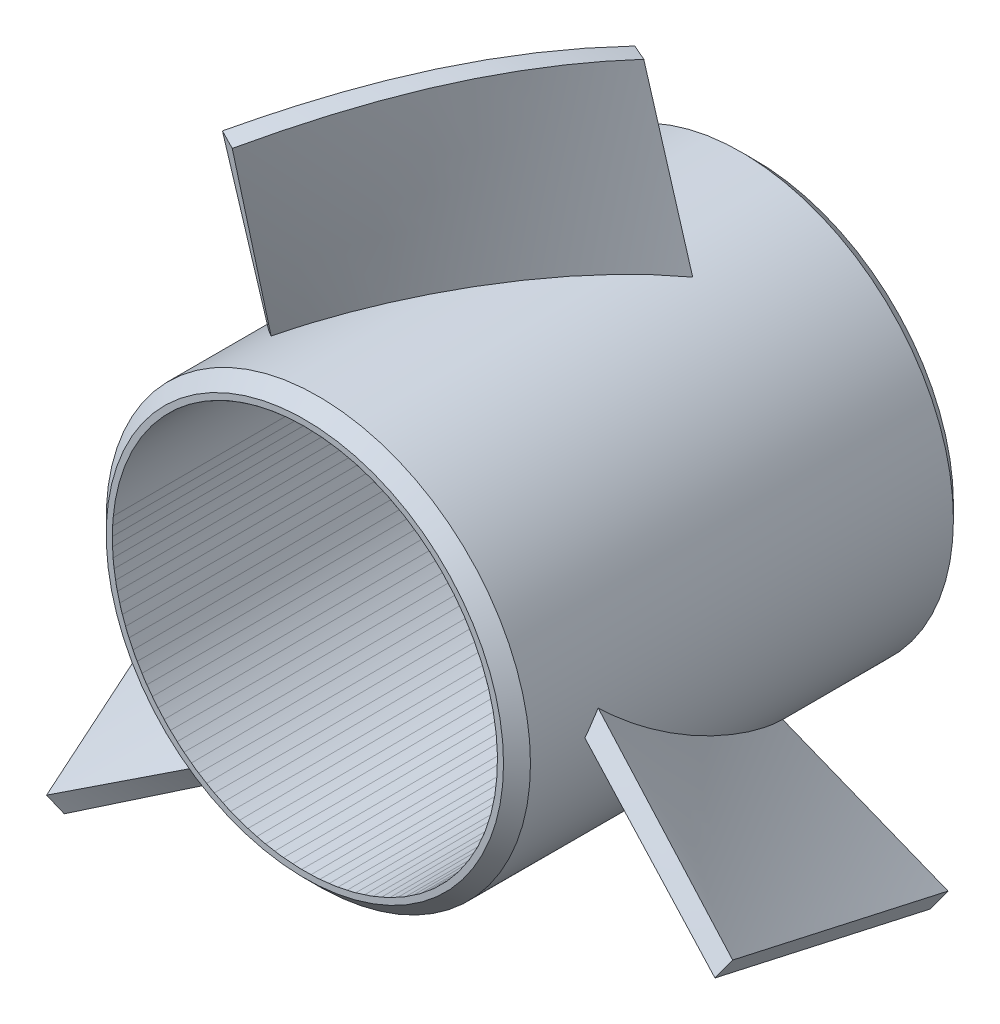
ISO-10303-21;
HEADER;
FILE_DESCRIPTION(('STEP AP214'),'2;1');
FILE_NAME('part.step','',(''),(''),'','','');
FILE_SCHEMA(('AUTOMOTIVE_DESIGN { 1 0 10303 214 1 1 1 1 }'));
ENDSEC;
DATA;
#1=APPLICATION_CONTEXT('core data for automotive mechanical design processes');
#2=APPLICATION_PROTOCOL_DEFINITION('international standard','automotive_design',2000,#1);
#3=PRODUCT_CONTEXT('',#1,'mechanical');
#4=PRODUCT('Part','Part','',(#3));
#5=PRODUCT_RELATED_PRODUCT_CATEGORY('part','',(#4));
#6=PRODUCT_DEFINITION_FORMATION('','',#4);
#7=PRODUCT_DEFINITION_CONTEXT('part definition',#1,'design');
#8=PRODUCT_DEFINITION('design','',#6,#7);
#9=PRODUCT_DEFINITION_SHAPE('','',#8);
#10=(LENGTH_UNIT() NAMED_UNIT(*) SI_UNIT(.MILLI.,.METRE.));
#11=(NAMED_UNIT(*) PLANE_ANGLE_UNIT() SI_UNIT($,.RADIAN.));
#12=(NAMED_UNIT(*) SI_UNIT($,.STERADIAN.) SOLID_ANGLE_UNIT());
#13=UNCERTAINTY_MEASURE_WITH_UNIT(LENGTH_MEASURE(1.E-05),#10,'distance_accuracy_value','');
#14=(GEOMETRIC_REPRESENTATION_CONTEXT(3) GLOBAL_UNCERTAINTY_ASSIGNED_CONTEXT((#13)) GLOBAL_UNIT_ASSIGNED_CONTEXT((#10,
#11,#12)) REPRESENTATION_CONTEXT('',''));
#15=CARTESIAN_POINT('',(0.,0.,0.));
#16=DIRECTION('',(0.,0.,1.));
#17=DIRECTION('',(1.,0.,0.));
#18=AXIS2_PLACEMENT_3D('',#15,#16,#17);
#19=CARTESIAN_POINT('',(0.,0.,30.5));
#20=DIRECTION('',(0.,0.,-1.));
#21=DIRECTION('',(-1.,0.,0.));
#22=AXIS2_PLACEMENT_3D('',#19,#20,#21);
#23=CYLINDRICAL_SURFACE('',#22,14.3);
#24=CARTESIAN_POINT('',(0.,0.,2.59999999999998));
#25=DIRECTION('',(0.,0.,1.));
#26=DIRECTION('',(1.,0.,0.));
#27=AXIS2_PLACEMENT_3D('',#24,#25,#26);
#28=CIRCLE('',#27,14.3);
#29=CARTESIAN_POINT('',(-14.1941993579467,1.73629046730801,2.59999999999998));
#30=VERTEX_POINT('',#29);
#31=CARTESIAN_POINT('',(13.1913162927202,5.52079473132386,2.59999999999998));
#32=VERTEX_POINT('',#31);
#33=EDGE_CURVE('E105',#30,#32,#28,.T.);
#34=ORIENTED_EDGE('',*,*,#33,.F.);
#35=DIRECTION('',(0.,0.,-1.));
#36=VECTOR('',#35,1.);
#37=CARTESIAN_POINT('',(-14.1941993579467,1.73629046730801,30.5));
#38=LINE('',#37,#36);
#39=CARTESIAN_POINT('',(-14.1941993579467,1.73629046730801,30.5));
#40=VERTEX_POINT('',#39);
#41=EDGE_CURVE('E87',#40,#30,#38,.T.);
#42=ORIENTED_EDGE('',*,*,#41,.F.);
#43=CARTESIAN_POINT('',(0.,0.,30.5));
#44=DIRECTION('',(0.,0.,1.));
#45=DIRECTION('',(1.,0.,0.));
#46=AXIS2_PLACEMENT_3D('',#43,#44,#45);
#47=CIRCLE('',#46,14.3);
#48=CARTESIAN_POINT('',(13.1913162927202,5.52079473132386,30.5));
#49=VERTEX_POINT('',#48);
#50=EDGE_CURVE('E93',#40,#49,#47,.T.);
#51=ORIENTED_EDGE('',*,*,#50,.T.);
#52=DIRECTION('',(0.,0.,-1.));
#53=VECTOR('',#52,1.);
#54=CARTESIAN_POINT('',(13.1913162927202,5.52079473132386,30.5));
#55=LINE('',#54,#53);
#56=EDGE_CURVE('E13',#49,#32,#55,.T.);
#57=ORIENTED_EDGE('',*,*,#56,.T.);
#58=EDGE_LOOP('',(#34,#42,#51,#57));
#59=FACE_BOUND('',#58,.T.);
#60=ADVANCED_FACE('F86',(#59),#23,.F.);
#61=OPEN_SHELL('',(#60));
#62=SHELL_BASED_SURFACE_MODEL('B2',(#61));
#63=CARTESIAN_POINT('',(-10.4805084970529,9.72876876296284,30.5));
#64=CARTESIAN_POINT('',(-8.63612131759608,11.7340936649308,30.5));
#65=CARTESIAN_POINT('',(-5.11090623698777,13.808493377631,30.5));
#66=CARTESIAN_POINT('',(0.226760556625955,14.4787593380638,30.5));
#67=CARTESIAN_POINT('',(6.07574194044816,13.6030996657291,30.5));
#68=CARTESIAN_POINT('',(10.0512133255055,10.7041597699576,30.5));
#69=CARTESIAN_POINT('',(11.8474759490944,8.00795314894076,30.5));
#70=B_SPLINE_CURVE_WITH_KNOTS('',3,(#63,#64,#65,#66,#67,#68,#69),.UNSPECIFIED.,.F.,.F.,(4,1,1,1,
4),(0.,0.318112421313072,0.457558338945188,0.623637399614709,1.),.UNSPECIFIED.);
#71=DIRECTION('',(0.,0.,-1.));
#72=VECTOR('',#71,1.);
#73=SURFACE_OF_LINEAR_EXTRUSION('',#70,#72);
#74=CARTESIAN_POINT('',(-10.4805084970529,9.72876876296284,1.59999999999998));
#75=CARTESIAN_POINT('',(-8.63612131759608,11.7340936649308,1.59999999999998));
#76=CARTESIAN_POINT('',(-5.11090623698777,13.808493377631,1.59999999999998));
#77=CARTESIAN_POINT('',(0.226760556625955,14.4787593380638,1.59999999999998));
#78=CARTESIAN_POINT('',(6.07574194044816,13.6030996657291,1.59999999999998));
#79=CARTESIAN_POINT('',(10.0512133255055,10.7041597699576,1.59999999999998));
#80=CARTESIAN_POINT('',(11.8474759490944,8.00795314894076,1.59999999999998));
#81=B_SPLINE_CURVE_WITH_KNOTS('',3,(#74,#75,#76,#77,#78,#79,#80),.UNSPECIFIED.,.F.,.F.,(4,1,1,1,
4),(0.,0.318112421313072,0.457558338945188,0.623637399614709,1.),.UNSPECIFIED.);
#82=CARTESIAN_POINT('',(-10.4805084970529,9.72876876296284,1.59999999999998));
#83=VERTEX_POINT('',#82);
#84=CARTESIAN_POINT('',(11.8474759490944,8.00795314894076,1.59999999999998));
#85=VERTEX_POINT('',#84);
#86=EDGE_CURVE('E209',#83,#85,#81,.T.);
#87=ORIENTED_EDGE('',*,*,#86,.F.);
#88=DIRECTION('',(0.,0.,-1.));
#89=VECTOR('',#88,1.);
#90=CARTESIAN_POINT('',(-10.4805084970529,9.72876876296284,30.5));
#91=LINE('',#90,#89);
#92=CARTESIAN_POINT('',(-10.4805084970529,9.72876876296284,30.5));
#93=VERTEX_POINT('',#92);
#94=EDGE_CURVE('E191',#93,#83,#91,.T.);
#95=ORIENTED_EDGE('',*,*,#94,.F.);
#96=CARTESIAN_POINT('',(11.8474759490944,8.00795314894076,30.5));
#97=VERTEX_POINT('',#96);
#98=EDGE_CURVE('E197',#93,#97,#70,.T.);
#99=ORIENTED_EDGE('',*,*,#98,.T.);
#100=DIRECTION('',(0.,0.,-1.));
#101=VECTOR('',#100,1.);
#102=CARTESIAN_POINT('',(11.8474759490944,8.00795314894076,30.5));
#103=LINE('',#102,#101);
#104=EDGE_CURVE('E136',#97,#85,#103,.T.);
#105=ORIENTED_EDGE('',*,*,#104,.T.);
#106=EDGE_LOOP('',(#87,#95,#99,#105));
#107=FACE_BOUND('',#106,.T.);
#108=ADVANCED_FACE('F189',(#107),#73,.T.);
#109=OPEN_SHELL('',(#108));
#110=SHELL_BASED_SURFACE_MODEL('B78',(#109));
#111=CARTESIAN_POINT('',(0.,0.,30.5));
#112=DIRECTION('',(0.,0.,-1.));
#113=DIRECTION('',(-1.,0.,0.));
#114=AXIS2_PLACEMENT_3D('',#111,#112,#113);
#115=CYLINDRICAL_SURFACE('',#114,14.3);
#116=CARTESIAN_POINT('',(0.,0.,30.5));
#117=DIRECTION('',(0.,0.,1.));
#118=DIRECTION('',(-0.732902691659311,0.680333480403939,0.));
#119=AXIS2_PLACEMENT_3D('',#116,#117,#118);
#120=CIRCLE('',#119,14.3);
#121=CARTESIAN_POINT('',(-10.4805276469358,9.72878655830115,30.5));
#122=VERTEX_POINT('',#121);
#123=CARTESIAN_POINT('',(11.8474755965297,8.00795291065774,30.5));
#124=VERTEX_POINT('',#123);
#125=EDGE_CURVE('E836',#122,#124,#120,.T.);
#126=ORIENTED_EDGE('',*,*,#125,.T.);
#127=DIRECTION('',(0.,0.,-1.));
#128=VECTOR('',#127,1.);
#129=CARTESIAN_POINT('',(11.8474759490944,8.00795314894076,30.5));
#130=LINE('',#129,#128);
#131=CARTESIAN_POINT('',(11.8474759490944,8.00795314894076,1.59999999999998));
#132=VERTEX_POINT('',#131);
#133=EDGE_CURVE('E947',#124,#132,#130,.T.);
#134=ORIENTED_EDGE('',*,*,#133,.T.);
#135=CARTESIAN_POINT('',(8.39771277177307,11.5744727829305,1.59999999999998));
#136=CARTESIAN_POINT('',(9.74454318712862,10.6009818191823,1.59999999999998));
#137=CARTESIAN_POINT('',(10.9233315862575,9.39510228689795,1.59999999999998));
#138=CARTESIAN_POINT('',(11.8474759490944,8.00795314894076,1.59999999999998));
#139=B_SPLINE_CURVE_WITH_KNOTS('',3,(#135,#136,#137,#138),.UNSPECIFIED.,.F.,.F.,(4,4),
(0.806368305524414,1.),.UNSPECIFIED.);
#140=CARTESIAN_POINT('',(8.39771277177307,11.5744727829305,1.59999999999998));
#141=VERTEX_POINT('',#140);
#142=EDGE_CURVE('E1010',#141,#132,#139,.T.);
#143=ORIENTED_EDGE('',*,*,#142,.F.);
#144=DIRECTION('',(0.,0.,-1.));
#145=VECTOR('',#144,1.);
#146=CARTESIAN_POINT('',(8.39771277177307,11.5744727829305,30.5));
#147=LINE('',#146,#145);
#148=CARTESIAN_POINT('',(8.39773529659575,11.5745038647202,30.5));
#149=VERTEX_POINT('',#148);
#150=EDGE_CURVE('E1030',#149,#141,#147,.T.);
#151=ORIENTED_EDGE('',*,*,#150,.F.);
#152=CARTESIAN_POINT('',(0.,0.,30.5));
#153=DIRECTION('',(0.,0.,1.));
#154=DIRECTION('',(0.5872526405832,0.809403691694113,0.));
#155=AXIS2_PLACEMENT_3D('',#152,#153,#154);
#156=CIRCLE('',#155,14.3);
#157=CARTESIAN_POINT('',(0.,14.3,30.5));
#158=VERTEX_POINT('',#157);
#159=EDGE_CURVE('E1129',#149,#158,#156,.T.);
#160=ORIENTED_EDGE('',*,*,#159,.T.);
#161=DIRECTION('',(0.,0.,-1.));
#162=VECTOR('',#161,1.);
#163=CARTESIAN_POINT('',(3.43936747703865E-12,14.3,30.5));
#164=LINE('',#163,#162);
#165=CARTESIAN_POINT('',(1.64106467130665E-11,14.3,14.7630842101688));
#166=VERTEX_POINT('',#165);
#167=EDGE_CURVE('E690',#166,#158,#164,.F.);
#168=ORIENTED_EDGE('',*,*,#167,.F.);
#169=CARTESIAN_POINT('',(4.20850817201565,13.6666915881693,8.88441838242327));
#170=CARTESIAN_POINT('',(4.04650131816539,13.7166392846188,9.10167851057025));
#171=CARTESIAN_POINT('',(3.88486619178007,13.7632925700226,9.31996106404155));
#172=CARTESIAN_POINT('',(3.55163749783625,13.8531635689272,9.77268890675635));
#173=CARTESIAN_POINT('',(3.38008871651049,13.8959530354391,10.0072523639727));
#174=CARTESIAN_POINT('',(3.02704638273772,13.9771635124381,10.4925399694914));
#175=CARTESIAN_POINT('',(2.84559400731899,14.0151506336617,10.7433663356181));
#176=CARTESIAN_POINT('',(2.47278394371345,14.0857555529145,11.2611682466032));
#177=CARTESIAN_POINT('',(2.28146566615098,14.1179310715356,11.5282325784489));
#178=CARTESIAN_POINT('',(1.95167491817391,14.1666218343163,11.9910825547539));
#179=CARTESIAN_POINT('',(1.81297373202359,14.1850165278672,12.186510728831));
#180=CARTESIAN_POINT('',(1.51184686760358,14.2205126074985,12.6118466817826));
#181=CARTESIAN_POINT('',(1.34947653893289,14.2368370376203,12.8418588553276));
#182=CARTESIAN_POINT('',(1.00096976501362,14.2659133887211,13.336364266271));
#183=CARTESIAN_POINT('',(0.814865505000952,14.2777814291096,13.6009321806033));
#184=CARTESIAN_POINT('',(0.419060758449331,14.2952956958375,14.1645945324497));
#185=CARTESIAN_POINT('',(0.209405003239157,14.2999449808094,14.4637517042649));
#186=CARTESIAN_POINT('',(1.64112434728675E-11,14.3,14.7630842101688));
#187=B_SPLINE_CURVE_WITH_KNOTS('',3,(#169,#170,#171,#172,#173,#174,#175,#176,#177,#178,#179,
#180,#181,#182,#183,#184,#185,#186),.UNSPECIFIED.,.F.,.F.,(4,2,2,2,2,2,2,2,4),(0.,
0.826697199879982,1.70780786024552,2.64341635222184,3.6335835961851,4.35460226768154,
5.20060919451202,6.17158130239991,7.26747725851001),.UNSPECIFIED.);
#188=CARTESIAN_POINT('',(4.208508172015,13.6666915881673,8.88441838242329));
#189=VERTEX_POINT('',#188);
#190=EDGE_CURVE('E855',#189,#166,#187,.T.);
#191=ORIENTED_EDGE('',*,*,#190,.F.);
#192=CARTESIAN_POINT('',(5.70302221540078,13.1121708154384,6.9287053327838));
#193=CARTESIAN_POINT('',(5.64378910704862,13.1379909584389,7.00413603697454));
#194=CARTESIAN_POINT('',(5.58460706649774,13.1633142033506,7.07977653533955));
#195=CARTESIAN_POINT('',(5.46535510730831,13.2134010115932,7.23272278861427));
#196=CARTESIAN_POINT('',(5.40528688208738,13.2381481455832,7.31003524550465));
#197=CARTESIAN_POINT('',(5.28426361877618,13.2870543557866,7.46632525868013));
#198=CARTESIAN_POINT('',(5.22331027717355,13.3111970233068,7.54530926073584));
#199=CARTESIAN_POINT('',(5.10051845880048,13.3588649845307,7.70494272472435));
#200=CARTESIAN_POINT('',(5.03868168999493,13.382373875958,7.78559839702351));
#201=CARTESIAN_POINT('',(4.91412515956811,13.4287445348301,7.94857539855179));
#202=CARTESIAN_POINT('',(4.85140712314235,13.4515899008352,8.03090271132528));
#203=CARTESIAN_POINT('',(4.72509073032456,13.4966031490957,8.19722324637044));
#204=CARTESIAN_POINT('',(4.66149412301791,13.5187546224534,8.28122223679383));
#205=CARTESIAN_POINT('',(4.533423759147,13.5623492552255,8.45088625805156));
#206=CARTESIAN_POINT('',(4.46895178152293,13.5837759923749,8.53655684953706));
#207=CARTESIAN_POINT('',(4.33913449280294,13.6258894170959,8.7095645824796));
#208=CARTESIAN_POINT('',(4.27379099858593,13.646559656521,8.79690709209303));
#209=CARTESIAN_POINT('',(4.20850817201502,13.6666915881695,8.88441838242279));
#210=B_SPLINE_CURVE_WITH_KNOTS('',3,(#192,#193,#194,#195,#196,#197,#198,#199,#200,#201,#202,
#203,#204,#205,#206,#207,#208,#209),.UNSPECIFIED.,.F.,.F.,(4,2,2,2,2,2,2,2,4),(0.,
0.297966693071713,0.600913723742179,0.908852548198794,1.22179423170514,1.5397495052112,
1.86272882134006,2.19074241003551,2.52380033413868),.UNSPECIFIED.);
#211=CARTESIAN_POINT('',(5.70240974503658,13.1124377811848,6.92832136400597));
#212=VERTEX_POINT('',#211);
#213=EDGE_CURVE('E934',#212,#189,#210,.T.);
#214=ORIENTED_EDGE('',*,*,#213,.F.);
#215=CARTESIAN_POINT('',(4.38974114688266,13.6094633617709,6.10008833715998));
#216=CARTESIAN_POINT('',(4.44536037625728,13.5914877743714,6.13544863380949));
#217=CARTESIAN_POINT('',(4.50091448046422,13.5731520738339,6.17072831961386));
#218=CARTESIAN_POINT('',(4.61179242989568,13.5357922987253,6.24106748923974));
#219=CARTESIAN_POINT('',(4.6671165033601,13.5167694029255,6.27612723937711));
#220=CARTESIAN_POINT('',(4.77752681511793,13.4780397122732,6.34602653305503));
#221=CARTESIAN_POINT('',(4.83261329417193,13.4583340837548,6.38086634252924));
#222=CARTESIAN_POINT('',(4.94254083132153,13.4182434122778,6.45032575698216));
#223=CARTESIAN_POINT('',(4.99738214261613,13.3978595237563,6.4849456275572));
#224=CARTESIAN_POINT('',(5.10681176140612,13.3564168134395,6.55396516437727));
#225=CARTESIAN_POINT('',(5.16140033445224,13.3353591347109,6.58836509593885));
#226=CARTESIAN_POINT('',(5.27031689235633,13.2925733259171,6.65694475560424));
#227=CARTESIAN_POINT('',(5.32464515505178,13.2708463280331,6.69112474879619));
#228=CARTESIAN_POINT('',(5.43303351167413,13.2267263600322,6.75926453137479));
#229=CARTESIAN_POINT('',(5.48709389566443,13.2043345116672,6.7932245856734));
#230=CARTESIAN_POINT('',(5.59493890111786,13.1588893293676,6.86092449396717));
#231=CARTESIAN_POINT('',(5.64872382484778,13.1358371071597,6.89466461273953));
#232=CARTESIAN_POINT('',(5.70240974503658,13.1124377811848,6.92832136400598));
#233=B_SPLINE_CURVE_WITH_KNOTS('',3,(#215,#216,#217,#218,#219,#220,#221,#222,#223,#224,#225,
#226,#227,#228,#229,#230,#231,#232),.UNSPECIFIED.,.F.,.F.,(4,2,2,2,2,2,2,2,4),(0.,
0.204944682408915,0.40955311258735,0.613827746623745,0.817770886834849,1.02138469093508,
1.22467118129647,1.42763225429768,1.63026968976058),.UNSPECIFIED.);
#234=CARTESIAN_POINT('',(4.38971670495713,13.6094712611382,6.10012058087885));
#235=VERTEX_POINT('',#234);
#236=EDGE_CURVE('E924',#235,#212,#233,.T.);
#237=ORIENTED_EDGE('',*,*,#236,.F.);
#238=CARTESIAN_POINT('',(-2.26142498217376E-08,14.300000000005,12.1900494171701));
#239=CARTESIAN_POINT('',(0.102412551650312,14.2999768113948,12.0436452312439));
#240=CARTESIAN_POINT('',(0.204891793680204,14.2988517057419,11.8972878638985));
#241=CARTESIAN_POINT('',(0.401813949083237,14.2945676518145,11.6163543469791));
#242=CARTESIAN_POINT('',(0.496246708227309,14.2915778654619,11.4817684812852));
#243=CARTESIAN_POINT('',(0.677044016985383,14.2840592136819,11.2243761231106));
#244=CARTESIAN_POINT('',(0.763399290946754,14.2796859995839,11.1015585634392));
#245=CARTESIAN_POINT('',(0.928035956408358,14.2698516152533,10.8677077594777));
#246=CARTESIAN_POINT('',(1.00630674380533,14.2645328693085,10.7566610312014));
#247=CARTESIAN_POINT('',(1.18138747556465,14.2511887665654,10.5086367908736));
#248=CARTESIAN_POINT('',(1.27822995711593,14.2428210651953,10.3717004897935));
#249=CARTESIAN_POINT('',(1.46791327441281,14.224482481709,10.1039848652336));
#250=CARTESIAN_POINT('',(1.56074672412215,14.2145962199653,9.97319450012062));
#251=CARTESIAN_POINT('',(1.74240168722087,14.1934508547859,9.71777389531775));
#252=CARTESIAN_POINT('',(1.8312156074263,14.1822736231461,9.59313148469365));
#253=CARTESIAN_POINT('',(2.00482551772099,14.1587666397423,9.35000816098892));
#254=CARTESIAN_POINT('',(2.089613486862,14.1465160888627,9.23151385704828));
#255=CARTESIAN_POINT('',(2.27028141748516,14.1187507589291,8.97961562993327));
#256=CARTESIAN_POINT('',(2.36618607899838,14.1030188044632,8.84625327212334));
#257=CARTESIAN_POINT('',(2.55517648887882,14.0700285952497,8.58418000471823));
#258=CARTESIAN_POINT('',(2.64825507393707,14.0528346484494,8.45545583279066));
#259=CARTESIAN_POINT('',(2.83158334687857,14.0170733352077,8.20266037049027));
#260=CARTESIAN_POINT('',(2.92182577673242,13.9985694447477,8.07857484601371));
#261=CARTESIAN_POINT('',(3.09947601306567,13.9603366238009,7.83505796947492));
#262=CARTESIAN_POINT('',(3.1868763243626,13.9406703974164,7.71561130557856));
#263=CARTESIAN_POINT('',(3.370696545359,13.8974706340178,7.46522212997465));
#264=CARTESIAN_POINT('',(3.46714061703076,13.8737470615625,7.33433005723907));
#265=CARTESIAN_POINT('',(3.65770865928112,13.824728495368,7.07669071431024));
#266=CARTESIAN_POINT('',(3.75182524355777,13.7994929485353,6.94992667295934));
#267=CARTESIAN_POINT('',(3.93772668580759,13.7475669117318,6.70054400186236));
#268=CARTESIAN_POINT('',(4.02950418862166,13.7209358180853,6.5779075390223));
#269=CARTESIAN_POINT('',(4.21072124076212,13.6663317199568,6.3367832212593));
#270=CARTESIAN_POINT('',(4.30015333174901,13.6384181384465,6.21827629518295));
#271=CARTESIAN_POINT('',(4.38971670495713,13.6094712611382,6.10012058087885));
#272=B_SPLINE_CURVE_WITH_KNOTS('',3,(#238,#239,#240,#241,#242,#243,#244,#245,#246,#247,#248,
#249,#250,#251,#252,#253,#254,#255,#256,#257,#258,#259,#260,#261,#262,#263,#264,#265,#266,#267,
#268,#269,#270,#271),.UNSPECIFIED.,.F.,.F.,(4,2,2,2,2,2,2,2,2,2,2,2,2,2,2,2,4),(0.,
0.536002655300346,1.02930578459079,1.47990205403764,1.88778560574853,2.39155889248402,
2.87362402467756,3.33398041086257,3.77262865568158,4.2676670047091,4.74699001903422,
5.21060467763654,5.65851955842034,6.15142590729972,6.63107150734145,7.09747611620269,
7.55066211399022),.UNSPECIFIED.);
#273=CARTESIAN_POINT('',(1.66153982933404E-12,14.3,12.1900494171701));
#274=VERTEX_POINT('',#273);
#275=EDGE_CURVE('E944',#274,#235,#272,.T.);
#276=ORIENTED_EDGE('',*,*,#275,.F.);
#277=CARTESIAN_POINT('',(3.43936747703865E-12,14.3,1.59999999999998));
#278=VERTEX_POINT('',#277);
#279=EDGE_CURVE('E940',#278,#274,#164,.F.);
#280=ORIENTED_EDGE('',*,*,#279,.F.);
#281=CARTESIAN_POINT('',(-3.54539757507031,13.8535250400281,1.59999999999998));
#282=CARTESIAN_POINT('',(-2.38820533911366,14.1503906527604,1.59999999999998));
#283=CARTESIAN_POINT('',(-1.19469795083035,14.3002627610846,1.59999999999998));
#284=CARTESIAN_POINT('',(0.,14.3,1.59999999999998));
#285=B_SPLINE_CURVE_WITH_KNOTS('',3,(#281,#282,#283,#284),.UNSPECIFIED.,.F.,.F.,(4,4),
(0.318112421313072,0.457558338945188),.UNSPECIFIED.);
#286=CARTESIAN_POINT('',(-3.54539757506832,13.8535250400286,1.59999999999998));
#287=VERTEX_POINT('',#286);
#288=EDGE_CURVE('E1064',#287,#278,#285,.T.);
#289=ORIENTED_EDGE('',*,*,#288,.F.);
#290=DIRECTION('',(0.,0.,-1.));
#291=VECTOR('',#290,1.);
#292=CARTESIAN_POINT('',(-3.54539757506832,13.8535250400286,30.5));
#293=LINE('',#292,#291);
#294=CARTESIAN_POINT('',(-3.54539757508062,13.8535250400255,17.2486373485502));
#295=VERTEX_POINT('',#294);
#296=EDGE_CURVE('E1015',#295,#287,#293,.T.);
#297=ORIENTED_EDGE('',*,*,#296,.F.);
#298=CARTESIAN_POINT('',(-7.55361756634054,12.1421934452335,22.616393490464));
#299=CARTESIAN_POINT('',(-7.39680987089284,12.2393990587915,22.4213534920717));
#300=CARTESIAN_POINT('',(-7.24014231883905,12.3323814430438,22.2241318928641));
#301=CARTESIAN_POINT('',(-6.91956490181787,12.5147128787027,21.8162711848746));
#302=CARTESIAN_POINT('',(-6.75567067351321,12.6036695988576,21.6054440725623));
#303=CARTESIAN_POINT('',(-6.42066597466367,12.7774023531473,21.1703839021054));
#304=CARTESIAN_POINT('',(-6.24957398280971,12.8617921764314,20.9459830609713));
#305=CARTESIAN_POINT('',(-5.90022467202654,13.0257902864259,20.4837516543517));
#306=CARTESIAN_POINT('',(-5.72198898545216,13.105016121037,20.2457692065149));
#307=CARTESIAN_POINT('',(-5.38981997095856,13.2448548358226,19.7985543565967));
#308=CARTESIAN_POINT('',(-5.23581031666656,13.3065414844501,19.5897124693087));
#309=CARTESIAN_POINT('',(-4.91942523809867,13.4270718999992,19.158134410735));
#310=CARTESIAN_POINT('',(-4.75707098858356,13.4855557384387,18.9352822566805));
#311=CARTESIAN_POINT('',(-4.42396487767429,13.5989055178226,18.4756792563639));
#312=CARTESIAN_POINT('',(-4.25323117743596,13.6534075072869,18.2388257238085));
#313=CARTESIAN_POINT('',(-3.9033905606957,13.7579492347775,17.7511911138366));
#314=CARTESIAN_POINT('',(-3.72430198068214,13.8076182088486,17.5003172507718));
#315=CARTESIAN_POINT('',(-3.54539757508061,13.8535250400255,17.2486373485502));
#316=B_SPLINE_CURVE_WITH_KNOTS('',3,(#298,#299,#300,#301,#302,#303,#304,#305,#306,#307,#308,
#309,#310,#311,#312,#313,#314,#315),.UNSPECIFIED.,.F.,.F.,(4,2,2,2,2,2,2,2,4),(0.,
0.805341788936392,1.64957670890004,2.53303208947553,3.45598501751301,4.25606246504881,
5.1015385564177,5.99250387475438,6.92903541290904),.UNSPECIFIED.);
#317=CARTESIAN_POINT('',(-7.55361756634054,12.1421934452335,22.616393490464));
#318=VERTEX_POINT('',#317);
#319=EDGE_CURVE('E684',#318,#295,#316,.T.);
#320=ORIENTED_EDGE('',*,*,#319,.F.);
#321=DIRECTION('',(0.,0.,-1.));
#322=VECTOR('',#321,1.);
#323=CARTESIAN_POINT('',(-7.5536175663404,12.1421934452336,30.5));
#324=LINE('',#323,#322);
#325=CARTESIAN_POINT('',(-7.5536175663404,12.1421934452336,1.59999999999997));
#326=VERTEX_POINT('',#325);
#327=EDGE_CURVE('E1011',#326,#318,#324,.F.);
#328=ORIENTED_EDGE('',*,*,#327,.F.);
#329=CARTESIAN_POINT('',(-10.4805084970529,9.72876876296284,1.59999999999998));
#330=CARTESIAN_POINT('',(-9.62219517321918,10.6619768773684,1.59999999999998));
#331=CARTESIAN_POINT('',(-8.63253974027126,11.4732328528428,1.59999999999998));
#332=CARTESIAN_POINT('',(-7.5536175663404,12.1421934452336,1.59999999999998));
#333=B_SPLINE_CURVE_WITH_KNOTS('',3,(#329,#330,#331,#332),.UNSPECIFIED.,.F.,.F.,(4,4),(0.,
0.148038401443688),.UNSPECIFIED.);
#334=CARTESIAN_POINT('',(-10.4805084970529,9.72876876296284,1.59999999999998));
#335=VERTEX_POINT('',#334);
#336=EDGE_CURVE('E1060',#335,#326,#333,.T.);
#337=ORIENTED_EDGE('',*,*,#336,.F.);
#338=DIRECTION('',(0.,0.,-1.));
#339=VECTOR('',#338,1.);
#340=CARTESIAN_POINT('',(-10.4805084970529,9.72876876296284,30.5));
#341=LINE('',#340,#339);
#342=EDGE_CURVE('E1062',#122,#335,#341,.T.);
#343=ORIENTED_EDGE('',*,*,#342,.F.);
#344=EDGE_LOOP('',(#126,#134,#143,#151,#160,#168,#191,#214,#237,#276,#280,#289,#297,#320,#328,
#337,#343));
#345=FACE_BOUND('',#344,.T.);
#346=CARTESIAN_POINT('',(0.,0.,0.));
#347=DIRECTION('',(0.,0.,1.));
#348=DIRECTION('',(1.,0.,0.));
#349=AXIS2_PLACEMENT_3D('',#346,#347,#348);
#350=CIRCLE('',#349,14.3);
#351=CARTESIAN_POINT('',(14.3,0.,0.));
#352=VERTEX_POINT('',#351);
#353=EDGE_CURVE('E832',#352,#352,#350,.T.);
#354=ORIENTED_EDGE('',*,*,#353,.F.);
#355=EDGE_LOOP('',(#354));
#356=FACE_BOUND('',#355,.T.);
#357=ADVANCED_FACE('F242',(#345,#356),#115,.F.);
#358=CARTESIAN_POINT('',(0.,0.,30.5));
#359=DIRECTION('',(0.,0.,1.));
#360=DIRECTION('',(1.,0.,0.));
#361=AXIS2_PLACEMENT_3D('',#358,#359,#360);
#362=PLANE('',#361);
#363=CARTESIAN_POINT('',(0.,0.,30.5));
#364=DIRECTION('',(0.,0.,1.));
#365=DIRECTION('',(1.,0.,0.));
#366=AXIS2_PLACEMENT_3D('',#363,#364,#365);
#367=CIRCLE('',#366,14.75);
#368=CARTESIAN_POINT('',(14.75,0.,30.5));
#369=VERTEX_POINT('',#368);
#370=EDGE_CURVE('E851',#369,#369,#367,.T.);
#371=ORIENTED_EDGE('',*,*,#370,.T.);
#372=EDGE_LOOP('',(#371));
#373=FACE_BOUND('',#372,.T.);
#374=CARTESIAN_POINT('',(11.8474759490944,8.00795314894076,30.5));
#375=CARTESIAN_POINT('',(10.9233315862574,9.39510228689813,30.5));
#376=CARTESIAN_POINT('',(9.7445431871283,10.6009818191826,30.5));
#377=CARTESIAN_POINT('',(8.39771277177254,11.5744727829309,30.5));
#378=B_SPLINE_CURVE_WITH_KNOTS('',3,(#374,#375,#376,#377),.UNSPECIFIED.,.F.,.F.,(4,4),
(0.806368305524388,1.),.UNSPECIFIED.);
#379=EDGE_CURVE('E843',#124,#149,#378,.T.);
#380=ORIENTED_EDGE('',*,*,#379,.F.);
#381=ORIENTED_EDGE('',*,*,#125,.F.);
#382=CARTESIAN_POINT('',(-7.55361756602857,12.1421934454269,30.5));
#383=CARTESIAN_POINT('',(-8.63253974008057,11.4732328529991,30.5));
#384=CARTESIAN_POINT('',(-9.62219517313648,10.6619768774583,30.5));
#385=CARTESIAN_POINT('',(-10.4805084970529,9.72876876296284,30.5));
#386=B_SPLINE_CURVE_WITH_KNOTS('',3,(#382,#383,#384,#385),.UNSPECIFIED.,.F.,.F.,(4,4),(0.,
0.14803840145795),.UNSPECIFIED.);
#387=CARTESIAN_POINT('',(-7.55363364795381,12.1422192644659,30.5));
#388=VERTEX_POINT('',#387);
#389=EDGE_CURVE('E1068',#122,#388,#386,.F.);
#390=ORIENTED_EDGE('',*,*,#389,.T.);
#391=CARTESIAN_POINT('',(0.,0.,30.5));
#392=DIRECTION('',(0.,0.,1.));
#393=DIRECTION('',(-0.247929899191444,0.968777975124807,0.));
#394=AXIS2_PLACEMENT_3D('',#391,#392,#393);
#395=CIRCLE('',#394,14.3);
#396=CARTESIAN_POINT('',(-3.54540951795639,13.8535718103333,30.5));
#397=VERTEX_POINT('',#396);
#398=EDGE_CURVE('E1183',#397,#388,#395,.T.);
#399=ORIENTED_EDGE('',*,*,#398,.F.);
#400=CARTESIAN_POINT('',(0.,14.3,30.5));
#401=CARTESIAN_POINT('',(-1.19469795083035,14.3002627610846,30.5));
#402=CARTESIAN_POINT('',(-2.38820533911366,14.1503906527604,30.5));
#403=CARTESIAN_POINT('',(-3.54539757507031,13.8535250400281,30.5));
#404=B_SPLINE_CURVE_WITH_KNOTS('',3,(#400,#401,#402,#403),.UNSPECIFIED.,.F.,.F.,(4,4),
(0.318112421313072,0.457558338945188),.UNSPECIFIED.);
#405=EDGE_CURVE('E1134',#397,#158,#404,.F.);
#406=ORIENTED_EDGE('',*,*,#405,.T.);
#407=ORIENTED_EDGE('',*,*,#159,.F.);
#408=EDGE_LOOP('',(#380,#381,#390,#399,#406,#407));
#409=FACE_BOUND('',#408,.T.);
#410=ADVANCED_FACE('F876',(#373,#409),#362,.T.);
#411=CARTESIAN_POINT('',(0.,0.,30.5));
#412=DIRECTION('',(0.,0.,-1.));
#413=DIRECTION('',(-1.,0.,0.));
#414=AXIS2_PLACEMENT_3D('',#411,#412,#413);
#415=CYLINDRICAL_SURFACE('',#414,15.75);
#416=CARTESIAN_POINT('',(15.7456423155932,-0.37047006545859,25.4568753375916));
#417=CARTESIAN_POINT('',(15.7504106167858,-0.167837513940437,25.3104477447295));
#418=CARTESIAN_POINT('',(15.7512618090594,0.0347091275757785,25.1637883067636));
#419=CARTESIAN_POINT('',(15.7462249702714,0.369319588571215,24.9209080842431));
#420=CARTESIAN_POINT('',(15.7425683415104,0.501505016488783,24.8248057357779));
#421=CARTESIAN_POINT('',(15.7319331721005,0.765678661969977,24.6323981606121));
#422=CARTESIAN_POINT('',(15.7249532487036,0.897666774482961,24.536092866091));
#423=CARTESIAN_POINT('',(15.7163177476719,1.02949329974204,24.4397130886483));
#424=B_SPLINE_CURVE_WITH_KNOTS('',3,(#416,#417,#418,#419,#420,#421,#422,#423),.UNSPECIFIED.,.F.,
.F.,(4,2,2,4),(0.,0.750092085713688,1.24046541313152,1.73104295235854),.UNSPECIFIED.);
#425=CARTESIAN_POINT('',(15.7456423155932,-0.370470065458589,25.4568753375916));
#426=VERTEX_POINT('',#425);
#427=CARTESIAN_POINT('',(15.7163177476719,1.02949329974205,24.4397130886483));
#428=VERTEX_POINT('',#427);
#429=EDGE_CURVE('E187',#426,#428,#424,.T.);
#430=ORIENTED_EDGE('',*,*,#429,.T.);
#431=CARTESIAN_POINT('',(15.7163177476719,1.02949329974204,24.4397130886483));
#432=CARTESIAN_POINT('',(15.7264954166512,0.874049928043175,24.2788970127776));
#433=CARTESIAN_POINT('',(15.7342648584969,0.720161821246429,24.1164535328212));
#434=CARTESIAN_POINT('',(15.7452603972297,0.415395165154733,23.7886485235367));
#435=CARTESIAN_POINT('',(15.7484870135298,0.264516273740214,23.6232873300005));
#436=CARTESIAN_POINT('',(15.7517590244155,-0.18301910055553,23.1241593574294));
#437=CARTESIAN_POINT('',(15.7454475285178,-0.475396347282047,22.7864929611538));
#438=CARTESIAN_POINT('',(15.7176335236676,-1.04924486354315,22.1032731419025));
#439=CARTESIAN_POINT('',(15.6961459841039,-1.33072659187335,21.7577278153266));
#440=CARTESIAN_POINT('',(15.6393927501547,-1.88392925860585,21.0601082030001));
#441=CARTESIAN_POINT('',(15.6041286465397,-2.15565131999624,20.7080346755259));
#442=CARTESIAN_POINT('',(15.5211053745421,-2.68891355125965,20.0003176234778));
#443=CARTESIAN_POINT('',(15.473405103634,-2.95049521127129,19.6446983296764));
#444=CARTESIAN_POINT('',(15.3662315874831,-3.46564138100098,18.9291977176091));
#445=CARTESIAN_POINT('',(15.3067526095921,-3.71920191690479,18.5693144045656));
#446=CARTESIAN_POINT('',(15.1766347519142,-4.21887687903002,17.8462714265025));
#447=CARTESIAN_POINT('',(15.10599276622,-4.46498921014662,17.4831108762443));
#448=CARTESIAN_POINT('',(14.9540089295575,-4.95022709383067,16.7544438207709));
#449=CARTESIAN_POINT('',(14.8726684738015,-5.18935355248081,16.3889376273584));
#450=CARTESIAN_POINT('',(14.7221265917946,-5.59964116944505,15.7517406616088));
#451=CARTESIAN_POINT('',(14.655288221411,-5.77226982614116,15.4804318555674));
#452=CARTESIAN_POINT('',(14.5159969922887,-6.11411393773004,14.9372272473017));
#453=CARTESIAN_POINT('',(14.4435458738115,-6.28333043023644,14.6653316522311));
#454=CARTESIAN_POINT('',(14.2930447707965,-6.61854377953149,14.1211404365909));
#455=CARTESIAN_POINT('',(14.2149952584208,-6.7845409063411,13.8488448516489));
#456=CARTESIAN_POINT('',(14.0532402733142,-7.113547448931,13.3039302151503));
#457=CARTESIAN_POINT('',(13.9695319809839,-7.27655532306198,13.0313110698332));
#458=CARTESIAN_POINT('',(13.7964398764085,-7.59962721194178,12.4860953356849));
#459=CARTESIAN_POINT('',(13.7070555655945,-7.75969096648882,12.2134987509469));
#460=CARTESIAN_POINT('',(13.5225308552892,-8.07696345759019,11.6685729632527));
#461=CARTESIAN_POINT('',(13.4273901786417,-8.23417205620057,11.3962437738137));
#462=CARTESIAN_POINT('',(13.2297466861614,-8.5481717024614,10.8479678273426));
#463=CARTESIAN_POINT('',(13.1271539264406,-8.70492005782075,10.5720290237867));
#464=CARTESIAN_POINT('',(12.9157591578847,-9.01559568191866,10.0209583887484));
#465=CARTESIAN_POINT('',(12.8069574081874,-9.16952306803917,9.74582652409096));
#466=CARTESIAN_POINT('',(12.5829442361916,-9.47458845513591,9.19664997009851));
#467=CARTESIAN_POINT('',(12.4677331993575,-9.62572662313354,8.92260521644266));
#468=CARTESIAN_POINT('',(12.2307285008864,-9.92512987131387,8.37606768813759));
#469=CARTESIAN_POINT('',(12.1089393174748,-10.0733968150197,8.10357399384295));
#470=CARTESIAN_POINT('',(11.8584127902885,-10.3671519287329,7.56025911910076));
#471=CARTESIAN_POINT('',(11.7296750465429,-10.5126399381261,7.28943803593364));
#472=CARTESIAN_POINT('',(11.4648798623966,-10.8007976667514,6.74979657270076));
#473=CARTESIAN_POINT('',(11.3288208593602,-10.9434667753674,6.48097663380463));
#474=CARTESIAN_POINT('',(11.1889397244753,-11.0846798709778,6.21337159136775));
#475=B_SPLINE_CURVE_WITH_KNOTS('',3,(#431,#432,#433,#434,#435,#436,#437,#438,#439,#440,#441,
#442,#443,#444,#445,#446,#447,#448,#449,#450,#451,#452,#453,#454,#455,#456,#457,#458,#459,#460,
#461,#462,#463,#464,#465,#466,#467,#468,#469,#470,#471,#472,#473,#474),.UNSPECIFIED.,.F.,.F.,(4,
2,2,2,2,2,2,2,2,2,2,2,2,2,2,2,2,2,2,2,2,4),(0.,0.671620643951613,1.34316449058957,
2.68269471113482,4.02090548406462,5.35896178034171,6.69079267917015,8.02327337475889,
9.35612546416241,10.6888039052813,11.6740778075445,12.6590474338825,13.643934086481,
14.6293151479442,15.6147828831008,16.6002981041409,17.6007977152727,18.6012556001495,
19.6016533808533,20.6013784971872,21.6011612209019,22.6011581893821),.UNSPECIFIED.);
#476=CARTESIAN_POINT('',(11.1889397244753,-11.0846798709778,6.21337159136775));
#477=VERTEX_POINT('',#476);
#478=EDGE_CURVE('E458',#428,#477,#475,.T.);
#479=ORIENTED_EDGE('',*,*,#478,.T.);
#480=CARTESIAN_POINT('',(11.1889397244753,-11.0846798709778,6.21337159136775));
#481=CARTESIAN_POINT('',(11.1089722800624,-11.165400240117,6.28175456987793));
#482=CARTESIAN_POINT('',(11.0280273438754,-11.2453589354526,6.34989819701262));
#483=CARTESIAN_POINT('',(10.8231590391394,-11.4433806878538,6.51973346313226));
#484=CARTESIAN_POINT('',(10.6980278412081,-11.5604564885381,6.62112206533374));
#485=CARTESIAN_POINT('',(10.4434109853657,-11.7909795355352,6.82287777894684));
#486=CARTESIAN_POINT('',(10.3139217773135,-11.9044236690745,6.92324396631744));
#487=CARTESIAN_POINT('',(10.1823523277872,-12.01591449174,7.02304826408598));
#488=B_SPLINE_CURVE_WITH_KNOTS('',3,(#480,#481,#482,#483,#484,#485,#486,#487),.UNSPECIFIED.,.F.,
.F.,(4,2,2,4),(0.,0.39784555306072,0.99508583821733,1.5928250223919),.UNSPECIFIED.);
#489=CARTESIAN_POINT('',(10.1823523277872,-12.01591449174,7.02304826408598));
#490=VERTEX_POINT('',#489);
#491=EDGE_CURVE('E253',#477,#490,#488,.T.);
#492=ORIENTED_EDGE('',*,*,#491,.T.);
#493=CARTESIAN_POINT('',(10.1823523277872,-12.01591449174,7.02304826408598));
#494=CARTESIAN_POINT('',(10.3675740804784,-11.8589219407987,7.33199026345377));
#495=CARTESIAN_POINT('',(10.5469235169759,-11.6996148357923,7.64323408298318));
#496=CARTESIAN_POINT('',(10.8945068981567,-11.3766730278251,8.26944069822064));
#497=CARTESIAN_POINT('',(11.0627458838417,-11.213040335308,8.58440172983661));
#498=CARTESIAN_POINT('',(11.3888869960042,-10.8816237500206,9.2174059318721));
#499=CARTESIAN_POINT('',(11.5467902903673,-10.713840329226,9.53544874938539));
#500=CARTESIAN_POINT('',(11.8529749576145,-10.3740942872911,10.1742851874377));
#501=CARTESIAN_POINT('',(12.0012489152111,-10.2021285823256,10.4950807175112));
#502=CARTESIAN_POINT('',(12.2885546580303,-9.85417821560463,11.1386768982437));
#503=CARTESIAN_POINT('',(12.4275853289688,-9.67819307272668,11.4614777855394));
#504=CARTESIAN_POINT('',(12.696798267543,-9.32221084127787,12.1085786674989));
#505=CARTESIAN_POINT('',(12.8269799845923,-9.14221350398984,12.4328787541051));
#506=CARTESIAN_POINT('',(13.0902234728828,-8.76166786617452,13.1119486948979));
#507=CARTESIAN_POINT('',(13.2224771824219,-8.56073537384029,13.4668165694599));
#508=CARTESIAN_POINT('',(13.4771500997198,-8.15392594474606,14.1772196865));
#509=CARTESIAN_POINT('',(13.5995697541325,-7.94804923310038,14.5327548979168));
#510=CARTESIAN_POINT('',(13.834792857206,-7.53115449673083,15.243977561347));
#511=CARTESIAN_POINT('',(13.9475965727,-7.32013661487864,15.5996650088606));
#512=CARTESIAN_POINT('',(14.1636530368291,-6.892802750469,16.3105162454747));
#513=CARTESIAN_POINT('',(14.266910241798,-6.67648930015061,16.6656802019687));
#514=CARTESIAN_POINT('',(14.4639443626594,-6.23815330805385,17.3751311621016));
#515=CARTESIAN_POINT('',(14.5577210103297,-6.01613060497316,17.7294181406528));
#516=CARTESIAN_POINT('',(14.7357012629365,-5.56598541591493,18.4365878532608));
#517=CARTESIAN_POINT('',(14.8199036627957,-5.3378621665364,18.789470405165));
#518=CARTESIAN_POINT('',(14.9809290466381,-4.86803936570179,19.5039320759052));
#519=CARTESIAN_POINT('',(15.0574477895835,-4.62613797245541,19.8654473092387));
#520=CARTESIAN_POINT('',(15.1996846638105,-4.1349085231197,20.5855075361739));
#521=CARTESIAN_POINT('',(15.2654037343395,-3.885581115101,20.944052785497));
#522=CARTESIAN_POINT('',(15.3854838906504,-3.37892766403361,21.6572451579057));
#523=CARTESIAN_POINT('',(15.4398479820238,-3.12160375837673,22.0118932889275));
#524=CARTESIAN_POINT('',(15.5365648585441,-2.59782345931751,22.7168684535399));
#525=CARTESIAN_POINT('',(15.5789001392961,-2.33135438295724,23.0671884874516));
#526=CARTESIAN_POINT('',(15.6504847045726,-1.78878181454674,23.7618418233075));
#527=CARTESIAN_POINT('',(15.6797307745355,-1.51267597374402,24.1061736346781));
#528=CARTESIAN_POINT('',(15.7128310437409,-1.09058264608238,24.6171038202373));
#529=CARTESIAN_POINT('',(15.7220718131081,-0.948480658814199,24.7865792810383));
#530=CARTESIAN_POINT('',(15.7367553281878,-0.661548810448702,25.1233914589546));
#531=CARTESIAN_POINT('',(15.7421977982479,-0.516718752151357,25.2907280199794));
#532=CARTESIAN_POINT('',(15.7456423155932,-0.37047006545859,25.4568753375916));
#533=B_SPLINE_CURVE_WITH_KNOTS('',3,(#493,#494,#495,#496,#497,#498,#499,#500,#501,#502,#503,
#504,#505,#506,#507,#508,#509,#510,#511,#512,#513,#514,#515,#516,#517,#518,#519,#520,#521,#522,
#523,#524,#525,#526,#527,#528,#529,#530,#531,#532),.UNSPECIFIED.,.F.,.F.,(4,2,2,2,2,2,2,2,2,2,2,
2,2,2,2,2,2,2,2,4),(0.,1.17870244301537,2.35686636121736,3.53489692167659,4.71382414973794,
5.89289324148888,7.07203562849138,8.35803201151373,9.64396995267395,10.9298721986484,
12.2151711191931,13.5005063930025,14.7860032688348,16.1107939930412,17.4354694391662,
18.75979380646,20.0860355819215,21.4126028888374,22.0766304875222,22.7407062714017),.UNSPECIFIED.);
#534=EDGE_CURVE('E450',#490,#426,#533,.T.);
#535=ORIENTED_EDGE('',*,*,#534,.T.);
#536=EDGE_LOOP('',(#430,#479,#492,#535));
#537=FACE_BOUND('',#536,.T.);
#538=CARTESIAN_POINT('',(-8.19365764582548,-13.4508912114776,25.4568753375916));
#539=CARTESIAN_POINT('',(-8.02055685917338,-13.5563369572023,25.3104477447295));
#540=CARTESIAN_POINT('',(-7.84557191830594,-13.6583474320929,25.1637883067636));
#541=CARTESIAN_POINT('',(-7.55327233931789,-13.8212906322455,24.9209080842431));
#542=CARTESIAN_POINT('',(-7.43696808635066,-13.884216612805,24.8248057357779));
#543=CARTESIAN_POINT('',(-7.20286941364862,-14.0070931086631,24.6323981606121));
#544=CARTESIAN_POINT('',(-7.0850743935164,-14.0670423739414,24.536092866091));
#545=CARTESIAN_POINT('',(-6.96659152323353,-14.1254770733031,24.4397130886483));
#546=B_SPLINE_CURVE_WITH_KNOTS('',3,(#538,#539,#540,#541,#542,#543,#544,#545),.UNSPECIFIED.,.F.,
.F.,(4,2,2,4),(0.,0.750092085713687,1.24046541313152,1.73104295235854),.UNSPECIFIED.);
#547=CARTESIAN_POINT('',(-8.19365764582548,-13.4508912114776,25.4568753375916));
#548=VERTEX_POINT('',#547);
#549=CARTESIAN_POINT('',(-6.96659152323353,-14.1254770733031,24.4397130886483));
#550=VERTEX_POINT('',#549);
#551=EDGE_CURVE('E604',#548,#550,#546,.T.);
#552=ORIENTED_EDGE('',*,*,#551,.T.);
#553=CARTESIAN_POINT('',(-6.96659152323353,-14.1254770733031,24.4397130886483));
#554=CARTESIAN_POINT('',(-7.1062982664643,-14.056569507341,24.2788970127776));
#555=CARTESIAN_POINT('',(-7.24345399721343,-13.9863539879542,24.1164535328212));
#556=CARTESIAN_POINT('',(-7.51288743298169,-13.8434930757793,23.7886485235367));
#557=CARTESIAN_POINT('',(-7.64516569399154,-13.7708479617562,23.6232873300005));
#558=CARTESIAN_POINT('',(-8.03437870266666,-13.5499139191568,23.1241593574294));
#559=CARTESIAN_POINT('',(-8.28442907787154,-13.3982593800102,22.7864929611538));
#560=CARTESIAN_POINT('',(-8.76748946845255,-13.0872474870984,22.1032731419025));
#561=CARTESIAN_POINT('',(-9.00051602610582,-12.9278978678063,21.7577278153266));
#562=CARTESIAN_POINT('',(-9.45122697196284,-12.6021467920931,21.0601082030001));
#563=CARTESIAN_POINT('',(-9.66891312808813,-12.4357461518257,20.7080346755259));
#564=CARTESIAN_POINT('',(-10.0892201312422,-12.0972147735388,20.0003176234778));
#565=CARTESIAN_POINT('',(-10.2919063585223,-11.9251142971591,19.6446983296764));
#566=CARTESIAN_POINT('',(-10.6844492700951,-11.5747262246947,18.9291977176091));
#567=CARTESIAN_POINT('',(-10.8742996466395,-11.3964356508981,18.5693144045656));
#568=CARTESIAN_POINT('',(-11.241971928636,-11.0339127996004,17.8462714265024));
#569=CARTESIAN_POINT('',(-11.4197904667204,-10.8496788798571,17.4831108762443));
#570=CARTESIAN_POINT('',(-11.7640268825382,-10.4754380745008,16.7544438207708));
#571=CARTESIAN_POINT('',(-11.9304462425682,-10.2854319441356,16.3889376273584));
#572=CARTESIAN_POINT('',(-12.210494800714,-9.94991504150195,15.7517406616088));
#573=CARTESIAN_POINT('',(-12.3265764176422,-9.80571698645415,15.4804318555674));
#574=CARTESIAN_POINT('',(-12.5529764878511,-9.51416518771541,14.9372272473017));
#575=CARTESIAN_POINT('',(-12.6632967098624,-9.36681243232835,14.6653316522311));
#576=CARTESIAN_POINT('',(-12.878349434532,-9.06886797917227,14.1211404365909));
#577=CARTESIAN_POINT('',(-12.9830824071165,-8.9182765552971,13.8488448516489));
#578=CARTESIAN_POINT('',(-13.1871329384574,-8.61368935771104,13.3039302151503));
#579=CARTESIAN_POINT('',(-13.2864477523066,-8.45969191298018,13.0313110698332));
#580=CARTESIAN_POINT('',(-13.4796901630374,-8.1482538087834,12.4860953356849));
#581=CARTESIAN_POINT('',(-13.5736172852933,-7.99081284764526,12.2134987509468));
#582=CARTESIAN_POINT('',(-13.7561209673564,-7.67237351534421,11.6685729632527));
#583=CARTESIAN_POINT('',(-13.8446972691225,-7.51137497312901,11.3962437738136));
#584=CARTESIAN_POINT('',(-14.0178071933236,-7.18321086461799,10.8479678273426));
#585=CARTESIAN_POINT('',(-14.1022588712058,-7.01598875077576,10.5720290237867));
#586=CARTESIAN_POINT('',(-14.2656144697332,-6.67757769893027,10.0209583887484));
#587=CARTESIAN_POINT('',(-14.3445186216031,-6.50638892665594,9.74582652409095));
#588=CARTESIAN_POINT('',(-14.4967064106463,-6.15985513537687,9.1966499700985));
#589=CARTESIAN_POINT('',(-14.5699903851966,-5.98451036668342,8.92260521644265));
#590=CARTESIAN_POINT('',(-14.7107788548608,-5.62955665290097,8.37606768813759));
#591=CARTESIAN_POINT('',(-14.7782872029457,-5.44995065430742,8.10357399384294));
#592=CARTESIAN_POINT('',(-14.9074233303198,-5.08611076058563,7.56025911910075));
#593=CARTESIAN_POINT('',(-14.9690507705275,-4.90187659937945,7.28943803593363));
#594=CARTESIAN_POINT('',(-15.0862050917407,-4.52847837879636,6.74979657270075));
#595=CARTESIAN_POINT('',(-15.1417306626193,-4.33931327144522,6.48097663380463));
#596=CARTESIAN_POINT('',(-15.1940842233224,-4.14756610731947,6.21337159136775));
#597=B_SPLINE_CURVE_WITH_KNOTS('',3,(#553,#554,#555,#556,#557,#558,#559,#560,#561,#562,#563,
#564,#565,#566,#567,#568,#569,#570,#571,#572,#573,#574,#575,#576,#577,#578,#579,#580,#581,#582,
#583,#584,#585,#586,#587,#588,#589,#590,#591,#592,#593,#594,#595,#596),.UNSPECIFIED.,.F.,.F.,(4,
2,2,2,2,2,2,2,2,2,2,2,2,2,2,2,2,2,2,2,2,4),(0.,0.671620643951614,1.34316449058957,
2.68269471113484,4.02090548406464,5.35896178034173,6.69079267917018,8.02327337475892,
9.35612546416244,10.6888039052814,11.6740778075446,12.6590474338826,13.643934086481,
14.6293151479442,15.6147828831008,16.600298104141,17.6007977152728,18.6012556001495,
19.6016533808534,20.6013784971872,21.6011612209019,22.6011581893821),.UNSPECIFIED.);
#598=CARTESIAN_POINT('',(-15.1940842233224,-4.14756610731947,6.21337159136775));
#599=VERTEX_POINT('',#598);
#600=EDGE_CURVE('E592',#550,#599,#597,.T.);
#601=ORIENTED_EDGE('',*,*,#600,.T.);
#602=CARTESIAN_POINT('',(-15.1940842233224,-4.14756610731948,6.21337159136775));
#603=CARTESIAN_POINT('',(-15.2240063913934,-4.03795208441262,6.28175456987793));
#604=CARTESIAN_POINT('',(-15.252780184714,-3.9278723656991,6.34989819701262));
#605=CARTESIAN_POINT('',(-15.3218379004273,-3.65144033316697,6.51973346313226));
#606=CARTESIAN_POINT('',(-15.3606629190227,-3.4845356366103,6.62112206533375));
#607=CARTESIAN_POINT('',(-15.4329933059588,-3.14876944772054,6.82287777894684));
#608=CARTESIAN_POINT('',(-15.466494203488,-2.97990643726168,6.92324396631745));
#609=CARTESIAN_POINT('',(-15.497263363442,-2.81021854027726,7.02304826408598));
#610=B_SPLINE_CURVE_WITH_KNOTS('',3,(#602,#603,#604,#605,#606,#607,#608,#609),.UNSPECIFIED.,.F.,
.F.,(4,2,2,4),(0.,0.397845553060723,0.995085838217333,1.5928250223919),.UNSPECIFIED.);
#611=CARTESIAN_POINT('',(-15.497263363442,-2.81021854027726,7.02304826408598));
#612=VERTEX_POINT('',#611);
#613=EDGE_CURVE('E612',#599,#612,#610,.T.);
#614=ORIENTED_EDGE('',*,*,#613,.T.);
#615=CARTESIAN_POINT('',(-15.497263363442,-2.81021854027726,7.02304826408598));
#616=CARTESIAN_POINT('',(-15.4539147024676,-3.04912155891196,7.33199026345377));
#617=CARTESIAN_POINT('',(-15.4056254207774,-3.28409627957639,7.64323408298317));
#618=CARTESIAN_POINT('',(-15.2997413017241,-3.74658322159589,8.26944069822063));
#619=CARTESIAN_POINT('',(-15.2421507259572,-3.97409880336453,8.58440172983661));
#620=CARTESIAN_POINT('',(-15.118206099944,-4.42225358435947,9.2174059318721));
#621=CARTESIAN_POINT('',(-15.0518530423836,-4.64289355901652,9.53544874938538));
#622=CARTESIAN_POINT('',(-14.9107166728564,-5.07793028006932,10.1742851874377));
#623=CARTESIAN_POINT('',(-14.8359269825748,-5.29232214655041,10.4950807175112));
#624=CARTESIAN_POINT('',(-14.678245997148,-5.71511140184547,11.1386768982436));
#625=CARTESIAN_POINT('',(-14.5953537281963,-5.92350806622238,11.4614777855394));
#626=CARTESIAN_POINT('',(-14.4216705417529,-6.33464442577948,12.1085786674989));
#627=CARTESIAN_POINT('',(-14.3308791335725,-6.53738376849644,12.4328787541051));
#628=CARTESIAN_POINT('',(-14.1329386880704,-6.95563213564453,13.1119486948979));
#629=CARTESIAN_POINT('',(-14.0250529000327,-7.17063345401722,13.4668165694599));
#630=CARTESIAN_POINT('',(-13.800082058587,-7.5945913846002,14.1772196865));
#631=CARTESIAN_POINT('',(-13.6829974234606,-7.80354827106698,14.5327548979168));
#632=CARTESIAN_POINT('',(-13.4395675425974,-8.21570482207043,15.243977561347));
#633=CARTESIAN_POINT('',(-13.3132225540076,-8.4189046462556,15.5996650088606));
#634=CARTESIAN_POINT('',(-13.051168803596,-8.81968196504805,16.3105162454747));
#635=CARTESIAN_POINT('',(-12.9154644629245,-9.01726205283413,16.6656802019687));
#636=CARTESIAN_POINT('',(-12.6343714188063,-9.40706660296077,17.3751311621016));
#637=CARTESIAN_POINT('',(-12.4889824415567,-9.59929091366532,17.7294181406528));
#638=CARTESIAN_POINT('',(-12.1881353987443,-9.9784989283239,18.4365878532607));
#639=CARTESIAN_POINT('',(-12.0326760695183,-10.1654819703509,18.789470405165));
#640=CARTESIAN_POINT('',(-11.7063102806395,-10.5398454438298,19.5039320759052));
#641=CARTESIAN_POINT('',(-11.53507690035,-10.7270633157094,19.8654473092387));
#642=CARTESIAN_POINT('',(-11.1807781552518,-11.0958587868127,20.5855075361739));
#643=CARTESIAN_POINT('',(-10.9977138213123,-11.2774368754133,20.944052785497));
#644=CARTESIAN_POINT('',(-10.6189791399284,-11.6347560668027,21.6572451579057));
#645=CARTESIAN_POINT('',(-10.4233121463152,-11.8104987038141,22.0118932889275));
#646=CARTESIAN_POINT('',(-10.0180635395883,-12.156148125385,22.7168684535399));
#647=CARTESIAN_POINT('',(-9.80846219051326,-12.3260460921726,23.0671884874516));
#648=CARTESIAN_POINT('',(-9.37437284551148,-12.6593264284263,23.7618418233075));
#649=CARTESIAN_POINT('',(-9.1498812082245,-12.8227071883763,24.1061736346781));
#650=CARTESIAN_POINT('',(-8.8008877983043,-13.0624195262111,24.6171038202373));
#651=CARTESIAN_POINT('',(-8.6824442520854,-13.1414732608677,24.7865792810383));
#652=CARTESIAN_POINT('',(-8.44129573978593,-13.2976554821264,25.1233914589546));
#653=CARTESIAN_POINT('',(-8.31859046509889,-13.3747838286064,25.2907280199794));
#654=CARTESIAN_POINT('',(-8.19365764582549,-13.4508912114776,25.4568753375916));
#655=B_SPLINE_CURVE_WITH_KNOTS('',3,(#615,#616,#617,#618,#619,#620,#621,#622,#623,#624,#625,
#626,#627,#628,#629,#630,#631,#632,#633,#634,#635,#636,#637,#638,#639,#640,#641,#642,#643,#644,
#645,#646,#647,#648,#649,#650,#651,#652,#653,#654),.UNSPECIFIED.,.F.,.F.,(4,2,2,2,2,2,2,2,2,2,2,
2,2,2,2,2,2,2,2,4),(0.,1.17870244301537,2.35686636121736,3.53489692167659,4.71382414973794,
5.89289324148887,7.07203562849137,8.35803201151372,9.64396995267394,10.9298721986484,
12.2151711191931,13.5005063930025,14.7860032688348,16.1107939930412,17.4354694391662,
18.75979380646,20.0860355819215,21.4126028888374,22.0766304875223,22.7407062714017),.UNSPECIFIED.);
#656=EDGE_CURVE('E676',#612,#548,#655,.T.);
#657=ORIENTED_EDGE('',*,*,#656,.T.);
#658=EDGE_LOOP('',(#552,#601,#614,#657));
#659=FACE_BOUND('',#658,.T.);
#660=CARTESIAN_POINT('',(-7.55198466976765,13.8213612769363,25.4568753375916));
#661=CARTESIAN_POINT('',(-7.7298537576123,13.7241744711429,25.3104477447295));
#662=CARTESIAN_POINT('',(-7.90568989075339,13.6236383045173,25.1637883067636));
#663=CARTESIAN_POINT('',(-8.19295263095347,13.4519710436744,24.9209080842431));
#664=CARTESIAN_POINT('',(-8.30560025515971,13.3827115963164,24.8248057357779));
#665=CARTESIAN_POINT('',(-8.52906375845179,13.2414144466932,24.6323981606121));
#666=CARTESIAN_POINT('',(-8.63987885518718,13.1693755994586,24.536092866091));
#667=CARTESIAN_POINT('',(-8.74972622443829,13.0959837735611,24.4397130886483));
#668=B_SPLINE_CURVE_WITH_KNOTS('',3,(#660,#661,#662,#663,#664,#665,#666,#667),.UNSPECIFIED.,.F.,
.F.,(4,2,2,4),(0.,0.750092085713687,1.24046541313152,1.73104295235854),.UNSPECIFIED.);
#669=CARTESIAN_POINT('',(-7.55198466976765,13.8213612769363,25.4568753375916));
#670=VERTEX_POINT('',#669);
#671=CARTESIAN_POINT('',(-8.7497262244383,13.0959837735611,24.4397130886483));
#672=VERTEX_POINT('',#671);
#673=EDGE_CURVE('E717',#670,#672,#668,.T.);
#674=ORIENTED_EDGE('',*,*,#673,.T.);
#675=CARTESIAN_POINT('',(-8.7497262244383,13.0959837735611,24.4397130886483));
#676=CARTESIAN_POINT('',(-8.62019715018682,13.1825195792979,24.2788970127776));
#677=CARTESIAN_POINT('',(-8.49081086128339,13.2661921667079,24.1164535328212));
#678=CARTESIAN_POINT('',(-8.23237296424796,13.4280979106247,23.7886485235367));
#679=CARTESIAN_POINT('',(-8.10332131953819,13.5063316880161,23.6232873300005));
#680=CARTESIAN_POINT('',(-7.71738032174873,13.7329330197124,23.1241593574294));
#681=CARTESIAN_POINT('',(-7.46101845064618,13.8736557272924,22.7864929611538));
#682=CARTESIAN_POINT('',(-6.95014405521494,14.1364923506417,22.1032731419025));
#683=CARTESIAN_POINT('',(-6.69562995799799,14.2586244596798,21.7577278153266));
#684=CARTESIAN_POINT('',(-6.18816577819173,14.4860760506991,21.0601082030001));
#685=CARTESIAN_POINT('',(-5.93521551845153,14.5913974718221,20.7080346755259));
#686=CARTESIAN_POINT('',(-5.43188524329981,14.7861283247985,20.0003176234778));
#687=CARTESIAN_POINT('',(-5.18149874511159,14.8756095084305,19.6446983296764));
#688=CARTESIAN_POINT('',(-4.68178231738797,15.0403676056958,18.9291977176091));
#689=CARTESIAN_POINT('',(-4.43245296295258,15.115637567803,18.5693144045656));
#690=CARTESIAN_POINT('',(-3.93466282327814,15.2527896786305,17.8462714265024));
#691=CARTESIAN_POINT('',(-3.68620229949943,15.3146680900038,17.4831108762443));
#692=CARTESIAN_POINT('',(-3.18998204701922,15.4256651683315,16.7544438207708));
#693=CARTESIAN_POINT('',(-2.94222223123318,15.4747854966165,16.3889376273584));
#694=CARTESIAN_POINT('',(-2.51163179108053,15.5495562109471,15.7517406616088));
#695=CARTESIAN_POINT('',(-2.32871180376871,15.5779868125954,15.4804318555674));
#696=CARTESIAN_POINT('',(-1.96302050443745,15.6282791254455,14.9372272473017));
#697=CARTESIAN_POINT('',(-1.78024916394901,15.6501428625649,14.6653316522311));
#698=CARTESIAN_POINT('',(-1.41469533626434,15.6874117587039,14.1211404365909));
#699=CARTESIAN_POINT('',(-1.23191285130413,15.7028174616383,13.8488448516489));
#700=CARTESIAN_POINT('',(-0.866107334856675,15.7272368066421,13.3039302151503));
#701=CARTESIAN_POINT('',(-0.683084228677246,15.7362472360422,13.0313110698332));
#702=CARTESIAN_POINT('',(-0.316749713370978,15.7478810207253,12.4860953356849));
#703=CARTESIAN_POINT('',(-0.133438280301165,15.7505038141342,12.2134987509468));
#704=CARTESIAN_POINT('',(0.233590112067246,15.7493369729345,11.6685729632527));
#705=CARTESIAN_POINT('',(0.417307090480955,15.7455470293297,11.3962437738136));
#706=CARTESIAN_POINT('',(0.788060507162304,15.7313825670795,10.8479678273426));
#707=CARTESIAN_POINT('',(0.975104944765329,15.7209088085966,10.5720290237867));
#708=CARTESIAN_POINT('',(1.34985531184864,15.693173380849,10.0209583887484));
#709=CARTESIAN_POINT('',(1.5375612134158,15.6759119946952,9.74582652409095));
#710=CARTESIAN_POINT('',(1.91376217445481,15.6344435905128,9.1966499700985));
#711=CARTESIAN_POINT('',(2.10225718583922,15.610236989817,8.92260521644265));
#712=CARTESIAN_POINT('',(2.48005035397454,15.5546865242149,8.37606768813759));
#713=CARTESIAN_POINT('',(2.66934788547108,15.5233474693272,8.10357399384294));
#714=CARTESIAN_POINT('',(3.04901054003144,15.4532626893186,7.56025911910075));
#715=CARTESIAN_POINT('',(3.23937572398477,15.4145165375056,7.28943803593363));
#716=CARTESIAN_POINT('',(3.62132522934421,15.3292760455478,6.74979657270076));
#717=CARTESIAN_POINT('',(3.81290980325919,15.2827800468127,6.48097663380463));
#718=CARTESIAN_POINT('',(4.00514449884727,15.2322459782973,6.21337159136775));
#719=B_SPLINE_CURVE_WITH_KNOTS('',3,(#675,#676,#677,#678,#679,#680,#681,#682,#683,#684,#685,
#686,#687,#688,#689,#690,#691,#692,#693,#694,#695,#696,#697,#698,#699,#700,#701,#702,#703,#704,
#705,#706,#707,#708,#709,#710,#711,#712,#713,#714,#715,#716,#717,#718),.UNSPECIFIED.,.F.,.F.,(4,
2,2,2,2,2,2,2,2,2,2,2,2,2,2,2,2,2,2,2,2,4),(0.,0.671620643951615,1.34316449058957,
2.68269471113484,4.02090548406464,5.35896178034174,6.69079267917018,8.02327337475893,
9.35612546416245,10.6888039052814,11.6740778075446,12.6590474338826,13.643934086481,
14.6293151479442,15.6147828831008,16.600298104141,17.6007977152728,18.6012556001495,
19.6016533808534,20.6013784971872,21.6011612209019,22.6011581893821),.UNSPECIFIED.);
#720=CARTESIAN_POINT('',(4.00514449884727,15.2322459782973,6.21337159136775));
#721=VERTEX_POINT('',#720);
#722=EDGE_CURVE('E726',#672,#721,#719,.T.);
#723=ORIENTED_EDGE('',*,*,#722,.T.);
#724=CARTESIAN_POINT('',(4.00514449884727,15.2322459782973,6.21337159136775));
#725=CARTESIAN_POINT('',(4.11503411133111,15.2033523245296,6.28175456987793));
#726=CARTESIAN_POINT('',(4.22475284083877,15.1732313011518,6.34989819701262));
#727=CARTESIAN_POINT('',(4.49867886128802,15.0948210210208,6.51973346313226));
#728=CARTESIAN_POINT('',(4.66263507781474,15.0449921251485,6.62112206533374));
#729=CARTESIAN_POINT('',(4.98958232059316,14.9397489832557,6.82287777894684));
#730=CARTESIAN_POINT('',(5.15257242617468,14.8843301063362,6.92324396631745));
#731=CARTESIAN_POINT('',(5.31491103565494,14.8261330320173,7.02304826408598));
#732=B_SPLINE_CURVE_WITH_KNOTS('',3,(#724,#725,#726,#727,#728,#729,#730,#731),.UNSPECIFIED.,.F.,
.F.,(4,2,2,4),(0.,0.397845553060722,0.995085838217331,1.5928250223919),.UNSPECIFIED.);
#733=CARTESIAN_POINT('',(5.31491103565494,14.8261330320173,7.02304826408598));
#734=VERTEX_POINT('',#733);
#735=EDGE_CURVE('E710',#721,#734,#732,.T.);
#736=ORIENTED_EDGE('',*,*,#735,.T.);
#737=CARTESIAN_POINT('',(5.31491103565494,14.8261330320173,7.02304826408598));
#738=CARTESIAN_POINT('',(5.0863406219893,14.9080434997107,7.33199026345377));
#739=CARTESIAN_POINT('',(4.85870190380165,14.9837111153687,7.64323408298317));
#740=CARTESIAN_POINT('',(4.40523440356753,15.123256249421,8.26944069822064));
#741=CARTESIAN_POINT('',(4.17940484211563,15.1871391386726,8.58440172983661));
#742=CARTESIAN_POINT('',(3.72931910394,15.3038773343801,9.2174059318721));
#743=CARTESIAN_POINT('',(3.50506275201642,15.3567338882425,9.53544874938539));
#744=CARTESIAN_POINT('',(3.05774171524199,15.4520245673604,10.1742851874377));
#745=CARTESIAN_POINT('',(2.83467806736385,15.494450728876,10.4950807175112));
#746=CARTESIAN_POINT('',(2.3896913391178,15.5692896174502,11.1386768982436));
#747=CARTESIAN_POINT('',(2.16776839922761,15.6017011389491,11.4614777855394));
#748=CARTESIAN_POINT('',(1.72487227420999,15.6568552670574,12.1085786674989));
#749=CARTESIAN_POINT('',(1.50389914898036,15.6795972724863,12.4328787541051));
#750=CARTESIAN_POINT('',(1.04271521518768,15.7173000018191,13.1119486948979));
#751=CARTESIAN_POINT('',(0.80257571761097,15.7313688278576,13.4668165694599));
#752=CARTESIAN_POINT('',(0.322931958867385,15.7485173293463,14.1772196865));
#753=CARTESIAN_POINT('',(0.0834276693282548,15.7515975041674,14.5327548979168));
#754=CARTESIAN_POINT('',(-0.395225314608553,15.7468593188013,15.243977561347));
#755=CARTESIAN_POINT('',(-0.634374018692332,15.7390412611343,15.5996650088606));
#756=CARTESIAN_POINT('',(-1.112484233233,15.7124847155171,16.3105162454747));
#757=CARTESIAN_POINT('',(-1.35144577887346,15.6937513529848,16.6656802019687));
#758=CARTESIAN_POINT('',(-1.82957294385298,15.6452199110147,17.3751311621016));
#759=CARTESIAN_POINT('',(-2.06873856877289,15.6154215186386,17.7294181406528));
#760=CARTESIAN_POINT('',(-2.54756586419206,15.5444843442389,18.4365878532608));
#761=CARTESIAN_POINT('',(-2.78722759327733,15.5033441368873,18.789470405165));
#762=CARTESIAN_POINT('',(-3.27461876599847,15.4078848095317,19.5039320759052));
#763=CARTESIAN_POINT('',(-3.52237088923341,15.3532012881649,19.8654473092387));
#764=CARTESIAN_POINT('',(-4.01890650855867,15.2307673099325,20.5855075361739));
#765=CARTESIAN_POINT('',(-4.26768991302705,15.1630179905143,20.944052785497));
#766=CARTESIAN_POINT('',(-4.76650475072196,15.0136837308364,21.6572451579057));
#767=CARTESIAN_POINT('',(-5.01653583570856,14.932102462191,22.0118932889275));
#768=CARTESIAN_POINT('',(-5.51850131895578,14.7539715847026,22.7168684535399));
#769=CARTESIAN_POINT('',(-5.77043794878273,14.65740047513,23.0671884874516));
#770=CARTESIAN_POINT('',(-6.27611185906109,14.4481082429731,23.7618418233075));
#771=CARTESIAN_POINT('',(-6.52984956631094,14.3353831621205,24.1061736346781));
#772=CARTESIAN_POINT('',(-6.91194324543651,14.1530021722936,24.6171038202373));
#773=CARTESIAN_POINT('',(-7.03962756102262,14.089953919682,24.7865792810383));
#774=CARTESIAN_POINT('',(-7.29545958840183,13.9592042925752,25.1233914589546));
#775=CARTESIAN_POINT('',(-7.42360733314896,13.8915025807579,25.2907280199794));
#776=CARTESIAN_POINT('',(-7.55198466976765,13.8213612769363,25.4568753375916));
#777=B_SPLINE_CURVE_WITH_KNOTS('',3,(#737,#738,#739,#740,#741,#742,#743,#744,#745,#746,#747,
#748,#749,#750,#751,#752,#753,#754,#755,#756,#757,#758,#759,#760,#761,#762,#763,#764,#765,#766,
#767,#768,#769,#770,#771,#772,#773,#774,#775,#776),.UNSPECIFIED.,.F.,.F.,(4,2,2,2,2,2,2,2,2,2,2,
2,2,2,2,2,2,2,2,4),(0.,1.17870244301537,2.35686636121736,3.53489692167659,4.71382414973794,
5.89289324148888,7.07203562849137,8.35803201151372,9.64396995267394,10.9298721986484,
12.2151711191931,13.5005063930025,14.7860032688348,16.1107939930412,17.4354694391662,
18.75979380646,20.0860355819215,21.4126028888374,22.0766304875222,22.7407062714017),.UNSPECIFIED.);
#778=EDGE_CURVE('E815',#734,#670,#777,.T.);
#779=ORIENTED_EDGE('',*,*,#778,.T.);
#780=EDGE_LOOP('',(#674,#723,#736,#779));
#781=FACE_BOUND('',#780,.T.);
#782=CARTESIAN_POINT('',(0.,0.,-1.89999999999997));
#783=DIRECTION('',(0.,0.,1.));
#784=DIRECTION('',(1.,0.,0.));
#785=AXIS2_PLACEMENT_3D('',#782,#783,#784);
#786=CIRCLE('',#785,15.75);
#787=CARTESIAN_POINT('',(15.75,0.,-1.89999999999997));
#788=VERTEX_POINT('',#787);
#789=EDGE_CURVE('E842',#788,#788,#786,.T.);
#790=ORIENTED_EDGE('',*,*,#789,.T.);
#791=EDGE_LOOP('',(#790));
#792=FACE_BOUND('',#791,.T.);
#793=CARTESIAN_POINT('',(0.,0.,29.5));
#794=DIRECTION('',(0.,0.,1.));
#795=DIRECTION('',(1.,0.,0.));
#796=AXIS2_PLACEMENT_3D('',#793,#794,#795);
#797=CIRCLE('',#796,15.75);
#798=CARTESIAN_POINT('',(15.75,0.,29.5));
#799=VERTEX_POINT('',#798);
#800=EDGE_CURVE('E838',#799,#799,#797,.F.);
#801=ORIENTED_EDGE('',*,*,#800,.T.);
#802=EDGE_LOOP('',(#801));
#803=FACE_BOUND('',#802,.T.);
#804=ADVANCED_FACE('F469',(#537,#659,#781,#792,#803),#415,.T.);
#805=CARTESIAN_POINT('',(-7.55361756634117,12.1421934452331,25.0971871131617));
#806=VERTEX_POINT('',#805);
#807=EDGE_CURVE('E1027',#806,#388,#324,.F.);
#808=ORIENTED_EDGE('',*,*,#807,.F.);
#809=CARTESIAN_POINT('',(-3.54539757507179,13.8535250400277,19.8018352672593));
#810=CARTESIAN_POINT('',(-3.72299855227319,13.8079525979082,20.049671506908));
#811=CARTESIAN_POINT('',(-3.90084955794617,13.7586553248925,20.2966555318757));
#812=CARTESIAN_POINT('',(-4.24868136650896,13.6548168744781,20.7769821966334));
#813=CARTESIAN_POINT('',(-4.418638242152,13.6006321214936,21.010419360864));
#814=CARTESIAN_POINT('',(-4.75064470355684,13.4878212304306,21.4636611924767));
#815=CARTESIAN_POINT('',(-4.91267072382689,13.4295460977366,21.6835702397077));
#816=CARTESIAN_POINT('',(-5.2288361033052,13.3092882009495,22.1097343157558));
#817=CARTESIAN_POINT('',(-5.38294947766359,13.2476535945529,22.3161068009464));
#818=CARTESIAN_POINT('',(-5.71553613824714,13.1078364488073,22.7579997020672));
#819=CARTESIAN_POINT('',(-5.89410201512,13.0285676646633,22.9931087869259));
#820=CARTESIAN_POINT('',(-6.24427893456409,12.8643675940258,23.4496034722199));
#821=CARTESIAN_POINT('',(-6.41586301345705,12.7798201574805,23.6711476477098));
#822=CARTESIAN_POINT('',(-6.75200641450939,12.6056379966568,24.1005049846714));
#823=CARTESIAN_POINT('',(-6.91654231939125,12.5163912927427,24.3084931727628));
#824=CARTESIAN_POINT('',(-7.23854346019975,12.333328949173,24.7106845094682));
#825=CARTESIAN_POINT('',(-7.39598867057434,12.2399077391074,24.9050835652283));
#826=CARTESIAN_POINT('',(-7.55361756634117,12.1421934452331,25.0971871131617));
#827=B_SPLINE_CURVE_WITH_KNOTS('',3,(#809,#810,#811,#812,#813,#814,#815,#816,#817,#818,#819,
#820,#821,#822,#823,#824,#825,#826),.UNSPECIFIED.,.F.,.F.,(4,2,2,2,2,2,2,2,4),(0.,
0.924854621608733,1.80614157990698,2.64394960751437,3.43838186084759,4.35529003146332,
5.23322854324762,6.07250301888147,6.87347290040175),.UNSPECIFIED.);
#828=CARTESIAN_POINT('',(-3.54539757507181,13.8535250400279,19.8018352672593));
#829=VERTEX_POINT('',#828);
#830=EDGE_CURVE('E984',#829,#806,#827,.T.);
#831=ORIENTED_EDGE('',*,*,#830,.F.);
#832=EDGE_CURVE('E1024',#397,#829,#293,.T.);
#833=ORIENTED_EDGE('',*,*,#832,.F.);
#834=ORIENTED_EDGE('',*,*,#398,.T.);
#835=EDGE_LOOP('',(#808,#831,#833,#834));
#836=FACE_BOUND('',#835,.T.);
#837=ADVANCED_FACE('F864',(#836),#115,.F.);
#838=CARTESIAN_POINT('',(0.,0.,0.));
#839=DIRECTION('',(0.,0.,1.));
#840=DIRECTION('',(1.,0.,0.));
#841=AXIS2_PLACEMENT_3D('',#838,#839,#840);
#842=PLANE('',#841);
#843=CARTESIAN_POINT('',(0.,0.,0.));
#844=DIRECTION('',(0.,0.,1.));
#845=DIRECTION('',(1.,0.,0.));
#846=AXIS2_PLACEMENT_3D('',#843,#844,#845);
#847=CIRCLE('',#846,5.0625);
#848=CARTESIAN_POINT('',(5.0625,0.,0.));
#849=VERTEX_POINT('',#848);
#850=EDGE_CURVE('E437',#849,#849,#847,.T.);
#851=ORIENTED_EDGE('',*,*,#850,.F.);
#852=EDGE_LOOP('',(#851));
#853=FACE_BOUND('',#852,.T.);
#854=CARTESIAN_POINT('',(-9.,0.,0.));
#855=DIRECTION('',(0.,0.,-1.));
#856=DIRECTION('',(-1.,0.,0.));
#857=AXIS2_PLACEMENT_3D('',#854,#855,#856);
#858=CIRCLE('',#857,1.5);
#859=CARTESIAN_POINT('',(-10.5,0.,0.));
#860=VERTEX_POINT('',#859);
#861=EDGE_CURVE('E837',#860,#860,#858,.T.);
#862=ORIENTED_EDGE('',*,*,#861,.T.);
#863=EDGE_LOOP('',(#862));
#864=FACE_BOUND('',#863,.T.);
#865=CARTESIAN_POINT('',(9.,0.,0.));
#866=DIRECTION('',(0.,0.,-1.));
#867=DIRECTION('',(-1.,0.,0.));
#868=AXIS2_PLACEMENT_3D('',#865,#866,#867);
#869=CIRCLE('',#868,1.5);
#870=CARTESIAN_POINT('',(7.5,0.,0.));
#871=VERTEX_POINT('',#870);
#872=EDGE_CURVE('E819',#871,#871,#869,.T.);
#873=ORIENTED_EDGE('',*,*,#872,.T.);
#874=EDGE_LOOP('',(#873));
#875=FACE_BOUND('',#874,.T.);
#876=ORIENTED_EDGE('',*,*,#353,.T.);
#877=EDGE_LOOP('',(#876));
#878=FACE_BOUND('',#877,.T.);
#879=ADVANCED_FACE('F873',(#853,#864,#875,#878),#842,.T.);
#880=CARTESIAN_POINT('',(0.,0.,-2.9));
#881=DIRECTION('',(0.,0.,1.));
#882=DIRECTION('',(1.,0.,0.));
#883=AXIS2_PLACEMENT_3D('',#880,#881,#882);
#884=PLANE('',#883);
#885=CARTESIAN_POINT('',(0.,0.,-2.9));
#886=DIRECTION('',(0.,0.,1.));
#887=DIRECTION('',(1.,0.,0.));
#888=AXIS2_PLACEMENT_3D('',#885,#886,#887);
#889=CIRCLE('',#888,5.0625);
#890=CARTESIAN_POINT('',(5.0625,0.,-2.9));
#891=VERTEX_POINT('',#890);
#892=EDGE_CURVE('E247',#891,#891,#889,.T.);
#893=ORIENTED_EDGE('',*,*,#892,.T.);
#894=EDGE_LOOP('',(#893));
#895=FACE_BOUND('',#894,.T.);
#896=CARTESIAN_POINT('',(0.,0.,-2.9));
#897=DIRECTION('',(0.,0.,1.));
#898=DIRECTION('',(1.,0.,0.));
#899=AXIS2_PLACEMENT_3D('',#896,#897,#898);
#900=CIRCLE('',#899,14.75);
#901=CARTESIAN_POINT('',(14.75,0.,-2.9));
#902=VERTEX_POINT('',#901);
#903=EDGE_CURVE('E847',#902,#902,#900,.F.);
#904=ORIENTED_EDGE('',*,*,#903,.T.);
#905=EDGE_LOOP('',(#904));
#906=FACE_BOUND('',#905,.T.);
#907=CARTESIAN_POINT('',(-9.,0.,-2.9));
#908=DIRECTION('',(0.,0.,-1.));
#909=DIRECTION('',(-1.,0.,0.));
#910=AXIS2_PLACEMENT_3D('',#907,#908,#909);
#911=CIRCLE('',#910,1.5);
#912=CARTESIAN_POINT('',(-10.5,0.,-2.9));
#913=VERTEX_POINT('',#912);
#914=EDGE_CURVE('E828',#913,#913,#911,.T.);
#915=ORIENTED_EDGE('',*,*,#914,.F.);
#916=EDGE_LOOP('',(#915));
#917=FACE_BOUND('',#916,.T.);
#918=CARTESIAN_POINT('',(9.,0.,-2.9));
#919=DIRECTION('',(0.,0.,-1.));
#920=DIRECTION('',(-1.,0.,0.));
#921=AXIS2_PLACEMENT_3D('',#918,#919,#920);
#922=CIRCLE('',#921,1.5);
#923=CARTESIAN_POINT('',(7.5,0.,-2.9));
#924=VERTEX_POINT('',#923);
#925=EDGE_CURVE('E822',#924,#924,#922,.T.);
#926=ORIENTED_EDGE('',*,*,#925,.F.);
#927=EDGE_LOOP('',(#926));
#928=FACE_BOUND('',#927,.T.);
#929=ADVANCED_FACE('F1103',(#895,#906,#917,#928),#884,.F.);
#930=CARTESIAN_POINT('',(9.,0.,0.));
#931=DIRECTION('',(0.,0.,-1.));
#932=DIRECTION('',(-1.,0.,0.));
#933=AXIS2_PLACEMENT_3D('',#930,#931,#932);
#934=CYLINDRICAL_SURFACE('',#933,1.5);
#935=ORIENTED_EDGE('',*,*,#872,.F.);
#936=EDGE_LOOP('',(#935));
#937=FACE_BOUND('',#936,.T.);
#938=ORIENTED_EDGE('',*,*,#925,.T.);
#939=EDGE_LOOP('',(#938));
#940=FACE_BOUND('',#939,.T.);
#941=ADVANCED_FACE('F1100',(#937,#940),#934,.F.);
#942=CARTESIAN_POINT('',(-9.,0.,0.));
#943=DIRECTION('',(0.,0.,-1.));
#944=DIRECTION('',(-1.,0.,0.));
#945=AXIS2_PLACEMENT_3D('',#942,#943,#944);
#946=CYLINDRICAL_SURFACE('',#945,1.5);
#947=ORIENTED_EDGE('',*,*,#861,.F.);
#948=EDGE_LOOP('',(#947));
#949=FACE_BOUND('',#948,.T.);
#950=ORIENTED_EDGE('',*,*,#914,.T.);
#951=EDGE_LOOP('',(#950));
#952=FACE_BOUND('',#951,.T.);
#953=ADVANCED_FACE('F1090',(#949,#952),#946,.F.);
#954=CARTESIAN_POINT('',(0.,0.,-1.89999999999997));
#955=DIRECTION('',(0.,0.,1.));
#956=DIRECTION('',(1.,0.,0.));
#957=AXIS2_PLACEMENT_3D('',#954,#955,#956);
#958=CONICAL_SURFACE('',#957,15.75,0.785398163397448);
#959=ORIENTED_EDGE('',*,*,#903,.F.);
#960=EDGE_LOOP('',(#959));
#961=FACE_BOUND('',#960,.T.);
#962=ORIENTED_EDGE('',*,*,#789,.F.);
#963=EDGE_LOOP('',(#962));
#964=FACE_BOUND('',#963,.T.);
#965=ADVANCED_FACE('F1099',(#961,#964),#958,.T.);
#966=CARTESIAN_POINT('',(0.,0.,30.5));
#967=DIRECTION('',(0.,0.,-1.));
#968=DIRECTION('',(-1.,0.,0.));
#969=AXIS2_PLACEMENT_3D('',#966,#967,#968);
#970=CONICAL_SURFACE('',#969,14.75,0.785398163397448);
#971=ORIENTED_EDGE('',*,*,#800,.F.);
#972=EDGE_LOOP('',(#971));
#973=FACE_BOUND('',#972,.T.);
#974=ORIENTED_EDGE('',*,*,#370,.F.);
#975=EDGE_LOOP('',(#974));
#976=FACE_BOUND('',#975,.T.);
#977=ADVANCED_FACE('F245',(#973,#976),#970,.T.);
#978=CARTESIAN_POINT('',(7.61516021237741,0.,5.15003853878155));
#979=CARTESIAN_POINT('',(0.825160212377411,28.65,7.15003853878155));
#980=CARTESIAN_POINT('',(4.90834946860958,0.,7.86546969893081));
#981=CARTESIAN_POINT('',(-0.795204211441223,28.65,10.6249212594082));
#982=CARTESIAN_POINT('',(2.20153872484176,0.,10.5809008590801));
#983=CARTESIAN_POINT('',(-2.41556863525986,28.65,14.0998039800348));
#984=CARTESIAN_POINT('',(-3.21208276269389,0.,16.0117631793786));
#985=CARTESIAN_POINT('',(-5.65629748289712,28.65,21.049569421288));
#986=CARTESIAN_POINT('',(-5.91889350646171,0.,18.7271943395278));
#987=CARTESIAN_POINT('',(-7.27666190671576,28.65,24.5244521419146));
#988=CARTESIAN_POINT('',(-8.62570425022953,0.,21.4426254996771));
#989=CARTESIAN_POINT('',(-8.89702633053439,28.65,27.9993348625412));
#990=B_SPLINE_SURFACE_WITH_KNOTS('',3,1,((#978,#979),(#980,#981),(#982,#983),(#984,#985),(#986,
#987),(#988,#989)),.UNSPECIFIED.,.F.,.F.,.F.,(4,2,4),(2,2),(0.,0.5,1.),(0.,1.),.UNSPECIFIED.);
#991=CARTESIAN_POINT('',(1.07577977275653,27.5925257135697,7.07621834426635));
#992=CARTESIAN_POINT('',(0.889673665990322,27.6677781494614,7.43077152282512));
#993=CARTESIAN_POINT('',(0.704812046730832,27.7391854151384,7.78677978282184));
#994=CARTESIAN_POINT('',(0.337379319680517,27.8741824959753,8.50144862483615));
#995=CARTESIAN_POINT('',(0.154808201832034,27.9377723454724,8.86010919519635));
#996=CARTESIAN_POINT('',(-0.389763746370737,28.1166241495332,9.93967584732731));
#997=CARTESIAN_POINT('',(-0.748629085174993,28.2199707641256,10.6641781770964));
#998=CARTESIAN_POINT('',(-1.45934086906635,28.3939547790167,12.119771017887));
#999=CARTESIAN_POINT('',(-1.81119264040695,28.4646179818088,12.8508558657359));
#1000=CARTESIAN_POINT('',(-2.50999076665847,28.5727481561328,14.3177348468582));
#1001=CARTESIAN_POINT('',(-2.85693745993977,28.6102174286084,15.0535286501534));
#1002=CARTESIAN_POINT('',(-3.66989659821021,28.6588790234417,16.7876203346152));
#1003=CARTESIAN_POINT('',(-4.13470807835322,28.6561272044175,17.7868986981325));
#1004=CARTESIAN_POINT('',(-5.06407512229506,28.5888985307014,19.7834027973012));
#1005=CARTESIAN_POINT('',(-5.5286307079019,28.524428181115,20.7806287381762));
#1006=CARTESIAN_POINT('',(-6.23212985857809,28.3813340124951,22.2764795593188));
#1007=CARTESIAN_POINT('',(-6.46924275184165,28.3254066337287,22.7782321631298));
#1008=CARTESIAN_POINT('',(-6.94543697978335,28.1980680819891,23.7788462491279));
#1009=CARTESIAN_POINT('',(-7.18451830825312,28.1266569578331,24.2777077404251));
#1010=CARTESIAN_POINT('',(-7.66536497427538,27.9685435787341,25.2718474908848));
#1011=CARTESIAN_POINT('',(-7.90713094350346,27.8818376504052,25.7671248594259));
#1012=CARTESIAN_POINT('',(-8.39393617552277,27.6934282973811,26.7532054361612));
#1013=CARTESIAN_POINT('',(-8.63897547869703,27.5917246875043,27.2440085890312));
#1014=CARTESIAN_POINT('',(-8.88597139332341,27.4826642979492,27.7321836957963));
#1015=B_SPLINE_CURVE_WITH_KNOTS('',3,(#991,#992,#993,#994,#995,#996,#997,#998,#999,#1000,#1001,
#1002,#1003,#1004,#1005,#1006,#1007,#1008,#1009,#1010,#1011,#1012,#1013,#1014),.UNSPECIFIED.,
.F.,.F.,(4,2,2,2,2,2,2,2,2,2,2,4),(0.,1.22226917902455,2.44453298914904,4.88902168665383,
7.33157723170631,9.77396344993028,13.0784827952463,16.3826538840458,18.0557727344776,
19.7288863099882,21.4024022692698,23.0759388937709),.UNSPECIFIED.);
#1016=CARTESIAN_POINT('',(1.07577977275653,27.5925257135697,7.07621834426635));
#1017=VERTEX_POINT('',#1016);
#1018=CARTESIAN_POINT('',(-8.88597139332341,27.4826642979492,27.7321836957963));
#1019=VERTEX_POINT('',#1018);
#1020=EDGE_CURVE('E766',#1017,#1019,#1015,.T.);
#1021=DIRECTION('',(0.230080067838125,-0.970809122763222,-0.0677702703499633));
#1022=VECTOR('',#1021,1.);
#1023=CARTESIAN_POINT('',(4.22016021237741,14.325,6.15003853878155));
#1024=LINE('',#1023,#1022);
#1025=EDGE_CURVE('E685',#1017,#721,#1024,.T.);
#1026=DIRECTION('',(-0.00923117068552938,0.97475679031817,0.223078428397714));
#1027=VECTOR('',#1026,1.);
#1028=CARTESIAN_POINT('',(-8.76136529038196,14.325,24.7209801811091));
#1029=LINE('',#1028,#1027);
#1030=EDGE_CURVE('E689',#672,#1019,#1029,.T.);
#1031=ORIENTED_EDGE('',*,*,#1020,.F.);
#1032=ORIENTED_EDGE('',*,*,#1025,.T.);
#1033=ORIENTED_EDGE('',*,*,#722,.F.);
#1034=ORIENTED_EDGE('',*,*,#1030,.T.);
#1035=EDGE_LOOP('',(#1031,#1032,#1033,#1034));
#1036=FACE_BOUND('',#1035,.T.);
#1037=ADVANCED_FACE('F739',(#1036),#990,.T.);
#1038=CARTESIAN_POINT('',(-8.62570425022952,0.,21.4426254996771));
#1039=CARTESIAN_POINT('',(-8.89702633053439,28.65,27.9993348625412));
#1040=CARTESIAN_POINT('',(-8.44899106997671,0.,21.6182301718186));
#1041=CARTESIAN_POINT('',(-8.67044938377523,28.65,28.1049894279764));
#1042=CARTESIAN_POINT('',(-8.27227788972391,0.,21.7938348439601));
#1043=CARTESIAN_POINT('',(-8.44387243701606,28.65,28.2106439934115));
#1044=CARTESIAN_POINT('',(-7.9188515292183,0.,22.1450441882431));
#1045=CARTESIAN_POINT('',(-7.99071854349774,28.65,28.4219531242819));
#1046=CARTESIAN_POINT('',(-7.7421383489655,0.,22.3206488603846));
#1047=CARTESIAN_POINT('',(-7.76414159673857,28.65,28.5276076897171));
#1048=CARTESIAN_POINT('',(-7.56542516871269,0.,22.4962535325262));
#1049=CARTESIAN_POINT('',(-7.53756464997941,28.65,28.6332622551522));
#1050=B_SPLINE_SURFACE_WITH_KNOTS('',3,1,((#1038,#1039),(#1040,#1041),(#1042,#1043),(#1044,
#1045),(#1046,#1047),(#1048,#1049)),.UNSPECIFIED.,.F.,.F.,.F.,(4,2,4),(2,2),(0.,0.5,1.),(0.,1.),.UNSPECIFIED.);
#1051=CARTESIAN_POINT('',(-8.88597139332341,27.4826642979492,27.7321836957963));
#1052=CARTESIAN_POINT('',(-8.77286909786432,27.4710606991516,27.7841282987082));
#1053=CARTESIAN_POINT('',(-8.65978805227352,27.4593618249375,27.8360978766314));
#1054=CARTESIAN_POINT('',(-8.43366983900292,27.4357721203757,27.9400888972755));
#1055=CARTESIAN_POINT('',(-8.32063267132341,27.4238812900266,27.9921103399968));
#1056=CARTESIAN_POINT('',(-7.98460178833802,27.3882383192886,28.146867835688));
#1057=CARTESIAN_POINT('',(-7.76167356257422,27.3642063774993,28.249681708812));
#1058=CARTESIAN_POINT('',(-7.53883875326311,27.3397925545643,28.3526076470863));
#1059=B_SPLINE_CURVE_WITH_KNOTS('',3,(#1051,#1052,#1053,#1054,#1055,#1056,#1057,#1058),
.UNSPECIFIED.,.F.,.F.,(4,2,2,4),(0.,0.375000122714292,0.750000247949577,1.49000377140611),.UNSPECIFIED.);
#1060=CARTESIAN_POINT('',(-7.53883875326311,27.3397925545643,28.3526076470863));
#1061=VERTEX_POINT('',#1060);
#1062=EDGE_CURVE('E756',#1019,#1061,#1059,.T.);
#1063=DIRECTION('',(0.000950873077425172,0.977817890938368,0.209454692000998));
#1064=VECTOR('',#1063,1.);
#1065=CARTESIAN_POINT('',(-7.55149490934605,14.325,25.5647578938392));
#1066=LINE('',#1065,#1064);
#1067=EDGE_CURVE('E709',#670,#1061,#1066,.T.);
#1068=ORIENTED_EDGE('',*,*,#1062,.F.);
#1069=ORIENTED_EDGE('',*,*,#1030,.F.);
#1070=ORIENTED_EDGE('',*,*,#673,.F.);
#1071=ORIENTED_EDGE('',*,*,#1067,.T.);
#1072=EDGE_LOOP('',(#1068,#1069,#1070,#1071));
#1073=FACE_BOUND('',#1072,.T.);
#1074=ADVANCED_FACE('F733',(#1073),#1050,.T.);
#1075=CARTESIAN_POINT('',(8.672154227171,0.,6.20696210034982));
#1076=CARTESIAN_POINT('',(2.18462189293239,28.65,7.7839659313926));
#1077=CARTESIAN_POINT('',(8.49598855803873,0.,6.03080817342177));
#1078=CARTESIAN_POINT('',(1.95804494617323,28.65,7.67831136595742));
#1079=CARTESIAN_POINT('',(8.31982288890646,0.,5.85465424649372));
#1080=CARTESIAN_POINT('',(1.73146799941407,28.65,7.57265680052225));
#1081=CARTESIAN_POINT('',(7.96749155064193,0.,5.50234639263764));
#1082=CARTESIAN_POINT('',(1.27831410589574,28.65,7.3613476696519));
#1083=CARTESIAN_POINT('',(7.79132588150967,0.,5.32619246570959));
#1084=CARTESIAN_POINT('',(1.05173715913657,28.65,7.25569310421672));
#1085=CARTESIAN_POINT('',(7.61516021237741,0.,5.15003853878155));
#1086=CARTESIAN_POINT('',(0.82516021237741,28.65,7.15003853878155));
#1087=B_SPLINE_SURFACE_WITH_KNOTS('',3,1,((#1075,#1076),(#1077,#1078),(#1079,#1080),(#1081,
#1082),(#1083,#1084),(#1085,#1086)),.UNSPECIFIED.,.F.,.F.,.F.,(4,2,4),(2,2),(0.,0.5,1.),(0.,1.),.UNSPECIFIED.);
#1088=CARTESIAN_POINT('',(2.39357652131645,27.7272223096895,7.73317277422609));
#1089=CARTESIAN_POINT('',(2.28201660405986,27.716278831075,7.67785868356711));
#1090=CARTESIAN_POINT('',(2.17049478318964,27.7052243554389,7.62248972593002));
#1091=CARTESIAN_POINT('',(1.94752954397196,27.6828911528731,7.51163929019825));
#1092=CARTESIAN_POINT('',(1.8360861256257,27.6716124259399,7.45615781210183));
#1093=CARTESIAN_POINT('',(1.50822705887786,27.6380858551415,7.29270629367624));
#1094=CARTESIAN_POINT('',(1.29192327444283,27.6155237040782,7.18457625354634));
#1095=CARTESIAN_POINT('',(1.07577977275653,27.5925257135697,7.07621834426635));
#1096=B_SPLINE_CURVE_WITH_KNOTS('',3,(#1088,#1089,#1090,#1091,#1092,#1093,#1094,#1095),
.UNSPECIFIED.,.F.,.F.,(4,2,2,4),(0.,0.375000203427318,0.750000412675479,1.47862485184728),.UNSPECIFIED.);
#1097=CARTESIAN_POINT('',(2.39357652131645,27.7272223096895,7.73317277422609));
#1098=VERTEX_POINT('',#1097);
#1099=EDGE_CURVE('E791',#1098,#1017,#1096,.T.);
#1100=DIRECTION('',(-0.220532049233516,0.973905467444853,0.05360742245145));
#1101=VECTOR('',#1100,1.);
#1102=CARTESIAN_POINT('',(5.42838806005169,14.325,6.9954640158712));
#1103=LINE('',#1102,#1101);
#1104=EDGE_CURVE('E811',#734,#1098,#1103,.T.);
#1105=ORIENTED_EDGE('',*,*,#1099,.F.);
#1106=ORIENTED_EDGE('',*,*,#1104,.F.);
#1107=ORIENTED_EDGE('',*,*,#735,.F.);
#1108=ORIENTED_EDGE('',*,*,#1025,.F.);
#1109=EDGE_LOOP('',(#1105,#1106,#1107,#1108));
#1110=FACE_BOUND('',#1109,.T.);
#1111=ADVANCED_FACE('F738',(#1110),#1087,.T.);
#1112=CARTESIAN_POINT('',(-7.5654251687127,0.,22.4962535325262));
#1113=CARTESIAN_POINT('',(-7.53756464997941,28.65,28.6332622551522));
#1114=CARTESIAN_POINT('',(-4.85916193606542,0.,19.7813716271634));
#1115=CARTESIAN_POINT('',(-5.9172002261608,28.65,25.1583795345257));
#1116=CARTESIAN_POINT('',(-2.15289870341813,0.,17.0664897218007));
#1117=CARTESIAN_POINT('',(-4.29683580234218,28.65,21.6834968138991));
#1118=CARTESIAN_POINT('',(3.25962776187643,0.,11.6367259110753));
#1119=CARTESIAN_POINT('',(-1.05610695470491,28.65,14.7337313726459));
#1120=CARTESIAN_POINT('',(5.96589099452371,0.,8.92184400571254));
#1121=CARTESIAN_POINT('',(0.564257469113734,28.65,11.2588486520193));
#1122=CARTESIAN_POINT('',(8.672154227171,0.,6.20696210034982));
#1123=CARTESIAN_POINT('',(2.18462189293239,28.65,7.7839659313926));
#1124=B_SPLINE_SURFACE_WITH_KNOTS('',3,1,((#1112,#1113),(#1114,#1115),(#1116,#1117),(#1118,
#1119),(#1120,#1121),(#1122,#1123)),.UNSPECIFIED.,.F.,.F.,.F.,(4,2,4),(2,2),(0.,0.5,1.),(0.,1.),.UNSPECIFIED.);
#1125=CARTESIAN_POINT('',(-7.53883875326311,27.3397925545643,28.3526076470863));
#1126=CARTESIAN_POINT('',(-7.32530179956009,27.4390414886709,27.9342006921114));
#1127=CARTESIAN_POINT('',(-7.11328197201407,27.5328912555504,27.5137608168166));
#1128=CARTESIAN_POINT('',(-6.69186709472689,27.7095943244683,26.6692764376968));
#1129=CARTESIAN_POINT('',(-6.48247201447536,27.7924477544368,26.2452319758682));
#1130=CARTESIAN_POINT('',(-5.8577365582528,28.0241698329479,24.9686431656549));
#1131=CARTESIAN_POINT('',(-5.44570886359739,28.1562644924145,24.1113731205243));
#1132=CARTESIAN_POINT('',(-4.62720226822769,28.3744899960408,22.3883645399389));
#1133=CARTESIAN_POINT('',(-4.22072344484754,28.460620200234,21.522625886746));
#1134=CARTESIAN_POINT('',(-3.61258619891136,28.5548349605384,20.2207599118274));
#1135=CARTESIAN_POINT('',(-3.41011616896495,28.5804106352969,19.7862159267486));
#1136=CARTESIAN_POINT('',(-3.00525519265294,28.6198644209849,18.9165239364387));
#1137=CARTESIAN_POINT('',(-2.80286425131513,28.6337418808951,18.481375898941));
#1138=CARTESIAN_POINT('',(-2.33064815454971,28.6524371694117,17.4668692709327));
#1139=CARTESIAN_POINT('',(-2.06069106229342,28.6527318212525,16.8874838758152));
#1140=CARTESIAN_POINT('',(-1.51914781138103,28.6326102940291,15.7297447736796));
#1141=CARTESIAN_POINT('',(-1.24756143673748,28.6121913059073,15.1513912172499));
#1142=CARTESIAN_POINT('',(-0.701807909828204,28.5507836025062,13.9969500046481));
#1143=CARTESIAN_POINT('',(-0.427640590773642,28.50979354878,13.4208624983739));
#1144=CARTESIAN_POINT('',(0.12456750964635,28.4074109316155,12.2713690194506));
#1145=CARTESIAN_POINT('',(0.402613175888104,28.3459898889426,11.6979679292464));
#1146=CARTESIAN_POINT('',(0.963068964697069,28.2030874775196,10.5558513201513));
#1147=CARTESIAN_POINT('',(1.24547887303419,28.1216070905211,9.98713557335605));
#1148=CARTESIAN_POINT('',(1.81545541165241,27.9390233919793,8.85552217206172));
#1149=CARTESIAN_POINT('',(2.10302165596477,27.8379215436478,8.29262408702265));
#1150=CARTESIAN_POINT('',(2.39357652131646,27.7272223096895,7.73317277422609));
#1151=B_SPLINE_CURVE_WITH_KNOTS('',3,(#1125,#1126,#1127,#1128,#1129,#1130,#1131,#1132,#1133,
#1134,#1135,#1136,#1137,#1138,#1139,#1140,#1141,#1142,#1143,#1144,#1145,#1146,#1147,#1148,#1149,
#1150),.UNSPECIFIED.,.F.,.F.,(4,2,2,2,2,2,2,2,2,2,2,2,4),(0.,1.44027773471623,2.8805387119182,
5.76013233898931,8.63976605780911,10.0798844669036,11.5200830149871,13.4373037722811,
15.3547845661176,17.2723901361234,19.1926799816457,21.1128758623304,23.0329286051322),.UNSPECIFIED.);
#1152=EDGE_CURVE('E765',#1061,#1098,#1151,.T.);
#1153=ORIENTED_EDGE('',*,*,#1152,.F.);
#1154=ORIENTED_EDGE('',*,*,#1067,.F.);
#1155=ORIENTED_EDGE('',*,*,#778,.F.);
#1156=ORIENTED_EDGE('',*,*,#1104,.T.);
#1157=EDGE_LOOP('',(#1153,#1154,#1155,#1156));
#1158=FACE_BOUND('',#1157,.T.);
#1159=ADVANCED_FACE('F1076',(#1158),#1124,.T.);
#1160=CARTESIAN_POINT('',(-10.4805084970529,9.72876876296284,30.5));
#1161=CARTESIAN_POINT('',(-8.63612131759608,11.7340936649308,30.5));
#1162=CARTESIAN_POINT('',(-5.11090623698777,13.808493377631,30.5));
#1163=CARTESIAN_POINT('',(0.226760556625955,14.4787593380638,30.5));
#1164=CARTESIAN_POINT('',(6.07574194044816,13.6030996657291,30.5));
#1165=CARTESIAN_POINT('',(10.0512133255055,10.7041597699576,30.5));
#1166=CARTESIAN_POINT('',(11.8474759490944,8.00795314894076,30.5));
#1167=B_SPLINE_CURVE_WITH_KNOTS('',3,(#1160,#1161,#1162,#1163,#1164,#1165,#1166),.UNSPECIFIED.,
.F.,.F.,(4,1,1,1,4),(0.,0.318112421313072,0.457558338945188,0.623637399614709,1.),.UNSPECIFIED.);
#1168=DIRECTION('',(0.,0.,-1.));
#1169=VECTOR('',#1168,1.);
#1170=SURFACE_OF_LINEAR_EXTRUSION('',#1167,#1169);
#1171=ORIENTED_EDGE('',*,*,#213,.T.);
#1172=ORIENTED_EDGE('',*,*,#190,.T.);
#1173=ORIENTED_EDGE('',*,*,#167,.T.);
#1174=ORIENTED_EDGE('',*,*,#405,.F.);
#1175=ORIENTED_EDGE('',*,*,#832,.T.);
#1176=ORIENTED_EDGE('',*,*,#830,.T.);
#1177=ORIENTED_EDGE('',*,*,#807,.T.);
#1178=ORIENTED_EDGE('',*,*,#389,.F.);
#1179=ORIENTED_EDGE('',*,*,#342,.T.);
#1180=ORIENTED_EDGE('',*,*,#336,.T.);
#1181=ORIENTED_EDGE('',*,*,#327,.T.);
#1182=ORIENTED_EDGE('',*,*,#319,.T.);
#1183=ORIENTED_EDGE('',*,*,#296,.T.);
#1184=ORIENTED_EDGE('',*,*,#288,.T.);
#1185=ORIENTED_EDGE('',*,*,#279,.T.);
#1186=ORIENTED_EDGE('',*,*,#275,.T.);
#1187=ORIENTED_EDGE('',*,*,#236,.T.);
#1188=EDGE_LOOP('',(#1171,#1172,#1173,#1174,#1175,#1176,#1177,#1178,#1179,#1180,#1181,#1182,
#1183,#1184,#1185,#1186,#1187));
#1189=FACE_BOUND('',#1188,.T.);
#1190=ADVANCED_FACE('F942',(#1189),#1170,.F.);
#1191=ORIENTED_EDGE('',*,*,#379,.T.);
#1192=ORIENTED_EDGE('',*,*,#150,.T.);
#1193=ORIENTED_EDGE('',*,*,#142,.T.);
#1194=ORIENTED_EDGE('',*,*,#133,.F.);
#1195=EDGE_LOOP('',(#1191,#1192,#1193,#1194));
#1196=FACE_BOUND('',#1195,.T.);
#1197=ADVANCED_FACE('F778',(#1196),#1170,.F.);
#1198=CARTESIAN_POINT('',(0.,-19.8805682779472,17.1520014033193));
#1199=DIRECTION('',(1.,0.,0.));
#1200=DIRECTION('',(0.,0.,-1.));
#1201=AXIS2_PLACEMENT_3D('',#1198,#1199,#1200);
#1202=CYLINDRICAL_SURFACE('',#1201,48.5305682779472);
#1203=ORIENTED_EDGE('',*,*,#1062,.T.);
#1204=ORIENTED_EDGE('',*,*,#1152,.T.);
#1205=ORIENTED_EDGE('',*,*,#1099,.T.);
#1206=ORIENTED_EDGE('',*,*,#1020,.T.);
#1207=EDGE_LOOP('',(#1203,#1204,#1205,#1206));
#1208=FACE_BOUND('',#1207,.T.);
#1209=ADVANCED_FACE('F775',(#1208),#1202,.T.);
#1210=CARTESIAN_POINT('',(-24.8116278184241,-14.3250000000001,0.));
#1211=DIRECTION('',(0.866025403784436,0.500000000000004,0.));
#1212=DIRECTION('',(0.,0.,-1.));
#1213=AXIS2_PLACEMENT_3D('',#1210,#1211,#1212);
#1214=PLANE('',#1213);
#1215=DIRECTION('',(0.211309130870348,-0.36599815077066,0.906307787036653));
#1216=VECTOR('',#1215,1.);
#1217=CARTESIAN_POINT('',(-20.3631146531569,-22.0300508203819,27.9993348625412));
#1218=LINE('',#1217,#1216);
#1219=CARTESIAN_POINT('',(-25.2242079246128,-13.6103902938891,7.15003853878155));
#1220=VERTEX_POINT('',#1219);
#1221=CARTESIAN_POINT('',(-20.3631146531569,-22.0300508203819,27.9993348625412));
#1222=VERTEX_POINT('',#1221);
#1223=EDGE_CURVE('E1233',#1220,#1222,#1218,.T.);
#1224=ORIENTED_EDGE('',*,*,#1223,.T.);
#1225=DIRECTION('',(-0.45315389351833,0.784885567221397,0.422618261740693));
#1226=VECTOR('',#1225,1.);
#1227=CARTESIAN_POINT('',(-20.3631146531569,-22.0300508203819,27.9993348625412));
#1228=LINE('',#1227,#1226);
#1229=CARTESIAN_POINT('',(-21.0428454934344,-20.8527224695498,28.6332622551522));
#1230=VERTEX_POINT('',#1229);
#1231=EDGE_CURVE('E798',#1222,#1230,#1228,.T.);
#1232=ORIENTED_EDGE('',*,*,#1231,.T.);
#1233=DIRECTION('',(-0.211309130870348,0.36599815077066,-0.906307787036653));
#1234=VECTOR('',#1233,1.);
#1235=CARTESIAN_POINT('',(-21.0428454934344,-20.8527224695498,28.6332622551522));
#1236=LINE('',#1235,#1234);
#1237=CARTESIAN_POINT('',(-25.9039387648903,-12.433061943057,7.7839659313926));
#1238=VERTEX_POINT('',#1237);
#1239=EDGE_CURVE('E650',#1230,#1238,#1236,.T.);
#1240=ORIENTED_EDGE('',*,*,#1239,.T.);
#1241=DIRECTION('',(0.45315389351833,-0.784885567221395,-0.422618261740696));
#1242=VECTOR('',#1241,1.);
#1243=CARTESIAN_POINT('',(-25.2242079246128,-13.6103902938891,7.15003853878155));
#1244=LINE('',#1243,#1242);
#1245=EDGE_CURVE('E1259',#1238,#1220,#1244,.T.);
#1246=ORIENTED_EDGE('',*,*,#1245,.T.);
#1247=EDGE_LOOP('',(#1224,#1232,#1240,#1246));
#1248=FACE_BOUND('',#1247,.T.);
#1249=ADVANCED_FACE('F667',(#1248),#1214,.F.);
#1250=CARTESIAN_POINT('',(3.78271258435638,-6.55185038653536,22.4962535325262));
#1251=CARTESIAN_POINT('',(-21.0428454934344,-20.8527224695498,28.6332622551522));
#1252=CARTESIAN_POINT('',(2.42958096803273,-4.20815767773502,19.7813716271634));
#1253=CARTESIAN_POINT('',(-21.8530277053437,-19.4494457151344,25.1583795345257));
#1254=CARTESIAN_POINT('',(1.07644935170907,-1.86446496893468,17.0664897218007));
#1255=CARTESIAN_POINT('',(-22.663209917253,-18.0461689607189,21.6834968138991));
#1256=CARTESIAN_POINT('',(-1.62981388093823,2.822920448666,11.6367259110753));
#1257=CARTESIAN_POINT('',(-24.2835743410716,-15.239615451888,14.7337313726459));
#1258=CARTESIAN_POINT('',(-2.98294549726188,5.16661315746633,8.92184400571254));
#1259=CARTESIAN_POINT('',(-25.093756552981,-13.8363386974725,11.2588486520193));
#1260=CARTESIAN_POINT('',(-4.33607711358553,7.51030586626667,6.20696210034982));
#1261=CARTESIAN_POINT('',(-25.9039387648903,-12.433061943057,7.7839659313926));
#1262=B_SPLINE_SURFACE_WITH_KNOTS('',3,1,((#1250,#1251),(#1252,#1253),(#1254,#1255),(#1256,
#1257),(#1258,#1259),(#1260,#1261)),.UNSPECIFIED.,.F.,.F.,.F.,(4,2,4),(2,2),(0.,0.5,1.),(0.,1.),.UNSPECIFIED.);
#1263=DIRECTION('',(-0.73316085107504,-0.677939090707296,0.05360742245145));
#1264=VECTOR('',#1263,1.);
#1265=CARTESIAN_POINT('',(-15.1200079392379,-2.46137803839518,6.9954640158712));
#1266=LINE('',#1265,#1264);
#1267=EDGE_CURVE('E1228',#612,#1238,#1266,.T.);
#1268=DIRECTION('',(-0.847290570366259,-0.488085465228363,0.209454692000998));
#1269=VECTOR('',#1268,1.);
#1270=CARTESIAN_POINT('',(-8.630066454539,-13.7022864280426,25.5647578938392));
#1271=LINE('',#1270,#1269);
#1272=EDGE_CURVE('E268',#548,#1230,#1271,.T.);
#1273=ORIENTED_EDGE('',*,*,#656,.F.);
#1274=ORIENTED_EDGE('',*,*,#1267,.T.);
#1275=ORIENTED_EDGE('',*,*,#1239,.F.);
#1276=ORIENTED_EDGE('',*,*,#1272,.F.);
#1277=EDGE_LOOP('',(#1273,#1274,#1275,#1276));
#1278=FACE_BOUND('',#1277,.T.);
#1279=ADVANCED_FACE('F656',(#1278),#1262,.T.);
#1280=CARTESIAN_POINT('',(-4.33607711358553,7.51030586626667,6.20696210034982));
#1281=CARTESIAN_POINT('',(-25.9039387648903,-12.433061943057,7.7839659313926));
#1282=CARTESIAN_POINT('',(-4.2479942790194,7.35774192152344,6.03080817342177));
#1283=CARTESIAN_POINT('',(-25.7906502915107,-12.6292833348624,7.67831136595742));
#1284=CARTESIAN_POINT('',(-4.15991144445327,7.20517797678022,5.85465424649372));
#1285=CARTESIAN_POINT('',(-25.6773618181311,-12.8255047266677,7.57265680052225));
#1286=CARTESIAN_POINT('',(-3.983745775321,6.90005008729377,5.50234639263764));
#1287=CARTESIAN_POINT('',(-25.450784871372,-13.2179475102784,7.3613476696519));
#1288=CARTESIAN_POINT('',(-3.89566294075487,6.74748614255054,5.32619246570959));
#1289=CARTESIAN_POINT('',(-25.3374963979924,-13.4141689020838,7.25569310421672));
#1290=CARTESIAN_POINT('',(-3.80758010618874,6.59492219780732,5.15003853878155));
#1291=CARTESIAN_POINT('',(-25.2242079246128,-13.6103902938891,7.15003853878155));
#1292=B_SPLINE_SURFACE_WITH_KNOTS('',3,1,((#1280,#1281),(#1282,#1283),(#1284,#1285),(#1286,
#1287),(#1288,#1289),(#1290,#1291)),.UNSPECIFIED.,.F.,.F.,.F.,(4,2,4),(2,2),(0.,0.5,1.),(0.,1.),.UNSPECIFIED.);
#1293=DIRECTION('',(0.725705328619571,0.684659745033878,-0.0677702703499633));
#1294=VECTOR('',#1293,1.);
#1295=CARTESIAN_POINT('',(-14.5158940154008,-3.5077340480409,6.15003853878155));
#1296=LINE('',#1295,#1294);
#1297=EDGE_CURVE('E466',#1220,#599,#1296,.T.);
#1298=ORIENTED_EDGE('',*,*,#613,.F.);
#1299=ORIENTED_EDGE('',*,*,#1297,.F.);
#1300=ORIENTED_EDGE('',*,*,#1245,.F.);
#1301=ORIENTED_EDGE('',*,*,#1267,.F.);
#1302=EDGE_LOOP('',(#1298,#1299,#1300,#1301));
#1303=FACE_BOUND('',#1302,.T.);
#1304=ADVANCED_FACE('F624',(#1303),#1292,.T.);
#1305=CARTESIAN_POINT('',(4.3128521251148,-7.47007900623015,21.4426254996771));
#1306=CARTESIAN_POINT('',(-20.3631146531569,-22.0300508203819,27.9993348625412));
#1307=CARTESIAN_POINT('',(4.22449553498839,-7.31704090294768,21.6182301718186));
#1308=CARTESIAN_POINT('',(-20.4764031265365,-21.8338294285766,28.1049894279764));
#1309=CARTESIAN_POINT('',(4.13613894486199,-7.16400279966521,21.7938348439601));
#1310=CARTESIAN_POINT('',(-20.589691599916,-21.6376080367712,28.2106439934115));
#1311=CARTESIAN_POINT('',(3.95942576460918,-6.85792659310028,22.1450441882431));
#1312=CARTESIAN_POINT('',(-20.8162685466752,-21.2451652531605,28.4219531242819));
#1313=CARTESIAN_POINT('',(3.87106917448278,-6.70488848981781,22.3206488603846));
#1314=CARTESIAN_POINT('',(-20.9295570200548,-21.0489438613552,28.5276076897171));
#1315=CARTESIAN_POINT('',(3.78271258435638,-6.55185038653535,22.4962535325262));
#1316=CARTESIAN_POINT('',(-21.0428454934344,-20.8527224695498,28.6332622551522));
#1317=B_SPLINE_SURFACE_WITH_KNOTS('',3,1,((#1305,#1306),(#1307,#1308),(#1309,#1310),(#1311,
#1312),(#1313,#1314),(#1315,#1316)),.UNSPECIFIED.,.F.,.F.,.F.,(4,2,4),(2,2),(0.,0.5,1.),(0.,1.),.UNSPECIFIED.);
#1318=DIRECTION('',(-0.839548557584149,-0.495372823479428,0.223078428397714));
#1319=VECTOR('',#1318,1.);
#1320=CARTESIAN_POINT('',(-8.02513126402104,-14.750064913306,24.7209801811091));
#1321=LINE('',#1320,#1319);
#1322=EDGE_CURVE('E1236',#550,#1222,#1321,.T.);
#1323=ORIENTED_EDGE('',*,*,#551,.F.);
#1324=ORIENTED_EDGE('',*,*,#1272,.T.);
#1325=ORIENTED_EDGE('',*,*,#1231,.F.);
#1326=ORIENTED_EDGE('',*,*,#1322,.F.);
#1327=EDGE_LOOP('',(#1323,#1324,#1325,#1326));
#1328=FACE_BOUND('',#1327,.T.);
#1329=ADVANCED_FACE('F619',(#1328),#1317,.T.);
#1330=CARTESIAN_POINT('',(-3.80758010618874,6.59492219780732,5.15003853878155));
#1331=CARTESIAN_POINT('',(-25.2242079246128,-13.6103902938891,7.15003853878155));
#1332=CARTESIAN_POINT('',(-2.45417473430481,4.25075533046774,7.86546969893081));
#1333=CARTESIAN_POINT('',(-24.4140257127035,-15.0136670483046,10.6249212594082));
#1334=CARTESIAN_POINT('',(-1.10076936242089,1.90658846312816,10.5809008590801));
#1335=CARTESIAN_POINT('',(-23.6038435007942,-16.4169438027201,14.0998039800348));
#1336=CARTESIAN_POINT('',(1.60604138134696,-2.781745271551,16.0117631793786));
#1337=CARTESIAN_POINT('',(-21.9834790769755,-19.223497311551,21.049569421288));
#1338=CARTESIAN_POINT('',(2.95944675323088,-5.12591213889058,18.7271943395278));
#1339=CARTESIAN_POINT('',(-21.1732968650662,-20.6267740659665,24.5244521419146));
#1340=CARTESIAN_POINT('',(4.3128521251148,-7.47007900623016,21.4426254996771));
#1341=CARTESIAN_POINT('',(-20.3631146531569,-22.0300508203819,27.9993348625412));
#1342=B_SPLINE_SURFACE_WITH_KNOTS('',3,1,((#1330,#1331),(#1332,#1333),(#1334,#1335),(#1336,
#1337),(#1338,#1339),(#1340,#1341)),.UNSPECIFIED.,.F.,.F.,.F.,(4,2,4),(2,2),(0.,0.5,1.),(0.,1.),.UNSPECIFIED.);
#1343=ORIENTED_EDGE('',*,*,#600,.F.);
#1344=ORIENTED_EDGE('',*,*,#1322,.T.);
#1345=ORIENTED_EDGE('',*,*,#1223,.F.);
#1346=ORIENTED_EDGE('',*,*,#1297,.T.);
#1347=EDGE_LOOP('',(#1343,#1344,#1345,#1346));
#1348=FACE_BOUND('',#1347,.T.);
#1349=ADVANCED_FACE('F524',(#1348),#1342,.T.);
#1350=CARTESIAN_POINT('',(4.31285212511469,7.47007900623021,21.4426254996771));
#1351=CARTESIAN_POINT('',(29.2601409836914,-6.6199491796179,27.9993348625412));
#1352=CARTESIAN_POINT('',(4.22449553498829,7.31704090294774,21.6182301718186));
#1353=CARTESIAN_POINT('',(29.1468525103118,-6.81617057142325,28.1049894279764));
#1354=CARTESIAN_POINT('',(4.13613894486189,7.16400279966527,21.7938348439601));
#1355=CARTESIAN_POINT('',(29.0335640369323,-7.0123919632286,28.2106439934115));
#1356=CARTESIAN_POINT('',(3.95942576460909,6.85792659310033,22.1450441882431));
#1357=CARTESIAN_POINT('',(28.8069870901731,-7.4048347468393,28.4219531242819));
#1358=CARTESIAN_POINT('',(3.87106917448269,6.70488848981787,22.3206488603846));
#1359=CARTESIAN_POINT('',(28.6936986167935,-7.60105613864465,28.5276076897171));
#1360=CARTESIAN_POINT('',(3.78271258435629,6.5518503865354,22.4962535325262));
#1361=CARTESIAN_POINT('',(28.5804101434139,-7.79727753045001,28.6332622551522));
#1362=B_SPLINE_SURFACE_WITH_KNOTS('',3,1,((#1350,#1351),(#1352,#1353),(#1354,#1355),(#1356,
#1357),(#1358,#1359),(#1360,#1361)),.UNSPECIFIED.,.F.,.F.,.F.,(4,2,4),(2,2),(0.,0.5,1.),(0.,1.),.UNSPECIFIED.);
#1363=DIRECTION('',(0.84633969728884,-0.489732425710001,0.209454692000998));
#1364=VECTOR('',#1363,1.);
#1365=CARTESIAN_POINT('',(16.1815613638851,-0.622713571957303,25.5647578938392));
#1366=LINE('',#1365,#1364);
#1367=CARTESIAN_POINT('',(28.5804101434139,-7.79727753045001,28.6332622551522));
#1368=VERTEX_POINT('',#1367);
#1369=EDGE_CURVE('E260',#426,#1368,#1366,.T.);
#1370=DIRECTION('',(-0.453153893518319,-0.784885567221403,0.422618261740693));
#1371=VECTOR('',#1370,1.);
#1372=CARTESIAN_POINT('',(29.2601409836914,-6.6199491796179,27.9993348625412));
#1373=LINE('',#1372,#1371);
#1374=CARTESIAN_POINT('',(29.2601409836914,-6.6199491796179,27.9993348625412));
#1375=VERTEX_POINT('',#1374);
#1376=EDGE_CURVE('E502',#1375,#1368,#1373,.T.);
#1377=DIRECTION('',(0.848779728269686,-0.479383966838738,0.223078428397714));
#1378=VECTOR('',#1377,1.);
#1379=CARTESIAN_POINT('',(16.7864965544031,0.425064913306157,24.7209801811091));
#1380=LINE('',#1379,#1378);
#1381=EDGE_CURVE('E422',#428,#1375,#1380,.T.);
#1382=ORIENTED_EDGE('',*,*,#429,.F.);
#1383=ORIENTED_EDGE('',*,*,#1369,.T.);
#1384=ORIENTED_EDGE('',*,*,#1376,.F.);
#1385=ORIENTED_EDGE('',*,*,#1381,.F.);
#1386=EDGE_LOOP('',(#1382,#1383,#1384,#1385));
#1387=FACE_BOUND('',#1386,.T.);
#1388=ADVANCED_FACE('F480',(#1387),#1362,.T.);
#1389=CARTESIAN_POINT('',(-4.33607711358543,-7.51030586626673,6.20696210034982));
#1390=CARTESIAN_POINT('',(23.7193168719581,-16.2169380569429,7.7839659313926));
#1391=CARTESIAN_POINT('',(-4.2479942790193,-7.3577419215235,6.03080817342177));
#1392=CARTESIAN_POINT('',(23.8326053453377,-16.0207166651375,7.67831136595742));
#1393=CARTESIAN_POINT('',(-4.15991144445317,-7.20517797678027,5.85465424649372));
#1394=CARTESIAN_POINT('',(23.9458938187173,-15.8244952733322,7.57265680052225));
#1395=CARTESIAN_POINT('',(-3.9837457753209,-6.90005008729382,5.50234639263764));
#1396=CARTESIAN_POINT('',(24.1724707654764,-15.4320524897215,7.3613476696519));
#1397=CARTESIAN_POINT('',(-3.89566294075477,-6.7474861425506,5.32619246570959));
#1398=CARTESIAN_POINT('',(24.285759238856,-15.2358310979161,7.25569310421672));
#1399=CARTESIAN_POINT('',(-3.80758010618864,-6.59492219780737,5.15003853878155));
#1400=CARTESIAN_POINT('',(24.3990477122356,-15.0396097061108,7.15003853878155));
#1401=B_SPLINE_SURFACE_WITH_KNOTS('',3,1,((#1389,#1390),(#1391,#1392),(#1393,#1394),(#1395,
#1396),(#1397,#1398),(#1399,#1400)),.UNSPECIFIED.,.F.,.F.,.F.,(4,2,4),(2,2),(0.,0.5,1.),(0.,1.),.UNSPECIFIED.);
#1402=DIRECTION('',(-0.955785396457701,0.286149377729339,-0.0677702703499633));
#1403=VECTOR('',#1402,1.);
#1404=CARTESIAN_POINT('',(10.2957338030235,-10.8172659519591,6.15003853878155));
#1405=LINE('',#1404,#1403);
#1406=CARTESIAN_POINT('',(24.3990477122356,-15.0396097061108,7.15003853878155));
#1407=VERTEX_POINT('',#1406);
#1408=EDGE_CURVE('E419',#1407,#477,#1405,.T.);
#1409=DIRECTION('',(0.453153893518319,0.784885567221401,-0.422618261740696));
#1410=VECTOR('',#1409,1.);
#1411=CARTESIAN_POINT('',(24.3990477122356,-15.0396097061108,7.15003853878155));
#1412=LINE('',#1411,#1410);
#1413=CARTESIAN_POINT('',(23.7193168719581,-16.2169380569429,7.7839659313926));
#1414=VERTEX_POINT('',#1413);
#1415=EDGE_CURVE('E398',#1414,#1407,#1412,.T.);
#1416=DIRECTION('',(0.953692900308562,-0.295966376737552,0.05360742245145));
#1417=VECTOR('',#1416,1.);
#1418=CARTESIAN_POINT('',(9.69161987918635,-11.8636219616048,6.9954640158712));
#1419=LINE('',#1418,#1417);
#1420=EDGE_CURVE('E425',#490,#1414,#1419,.T.);
#1421=ORIENTED_EDGE('',*,*,#491,.F.);
#1422=ORIENTED_EDGE('',*,*,#1408,.F.);
#1423=ORIENTED_EDGE('',*,*,#1415,.F.);
#1424=ORIENTED_EDGE('',*,*,#1420,.F.);
#1425=EDGE_LOOP('',(#1421,#1422,#1423,#1424));
#1426=FACE_BOUND('',#1425,.T.);
#1427=ADVANCED_FACE('F429',(#1426),#1401,.T.);
#1428=CARTESIAN_POINT('',(-3.80758010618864,-6.59492219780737,5.15003853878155));
#1429=CARTESIAN_POINT('',(24.3990477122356,-15.0396097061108,7.15003853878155));
#1430=CARTESIAN_POINT('',(-2.45417473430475,-4.25075533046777,7.86546969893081));
#1431=CARTESIAN_POINT('',(25.2092299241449,-13.6363329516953,10.6249212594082));
#1432=CARTESIAN_POINT('',(-1.10076936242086,-1.90658846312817,10.5809008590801));
#1433=CARTESIAN_POINT('',(26.0194121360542,-12.2330561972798,14.0998039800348));
#1434=CARTESIAN_POINT('',(1.60604138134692,2.78174527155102,16.0117631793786));
#1435=CARTESIAN_POINT('',(27.6397765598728,-9.42650268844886,21.049569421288));
#1436=CARTESIAN_POINT('',(2.95944675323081,5.12591213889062,18.7271943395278));
#1437=CARTESIAN_POINT('',(28.4499587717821,-8.02322593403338,24.5244521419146));
#1438=CARTESIAN_POINT('',(4.31285212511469,7.47007900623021,21.4426254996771));
#1439=CARTESIAN_POINT('',(29.2601409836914,-6.6199491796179,27.9993348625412));
#1440=B_SPLINE_SURFACE_WITH_KNOTS('',3,1,((#1428,#1429),(#1430,#1431),(#1432,#1433),(#1434,
#1435),(#1436,#1437),(#1438,#1439)),.UNSPECIFIED.,.F.,.F.,.F.,(4,2,4),(2,2),(0.,0.5,1.),(0.,1.),.UNSPECIFIED.);
#1441=DIRECTION('',(0.211309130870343,0.365998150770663,0.906307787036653));
#1442=VECTOR('',#1441,1.);
#1443=CARTESIAN_POINT('',(29.2601409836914,-6.6199491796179,27.9993348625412));
#1444=LINE('',#1443,#1442);
#1445=EDGE_CURVE('E403',#1407,#1375,#1444,.T.);
#1446=ORIENTED_EDGE('',*,*,#478,.F.);
#1447=ORIENTED_EDGE('',*,*,#1381,.T.);
#1448=ORIENTED_EDGE('',*,*,#1445,.F.);
#1449=ORIENTED_EDGE('',*,*,#1408,.T.);
#1450=EDGE_LOOP('',(#1446,#1447,#1448,#1449));
#1451=FACE_BOUND('',#1450,.T.);
#1452=ADVANCED_FACE('F418',(#1451),#1440,.T.);
#1453=CARTESIAN_POINT('',(3.78271258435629,6.55185038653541,22.4962535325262));
#1454=CARTESIAN_POINT('',(28.5804101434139,-7.79727753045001,28.6332622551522));
#1455=CARTESIAN_POINT('',(2.42958096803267,4.20815767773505,19.7813716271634));
#1456=CARTESIAN_POINT('',(27.7702279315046,-9.20055428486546,25.1583795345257));
#1457=CARTESIAN_POINT('',(1.07644935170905,1.86446496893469,17.0664897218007));
#1458=CARTESIAN_POINT('',(26.9600457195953,-10.6038310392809,21.6834968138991));
#1459=CARTESIAN_POINT('',(-1.62981388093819,-2.82292044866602,11.6367259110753));
#1460=CARTESIAN_POINT('',(25.3396812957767,-13.4103845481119,14.7337313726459));
#1461=CARTESIAN_POINT('',(-2.98294549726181,-5.16661315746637,8.92184400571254));
#1462=CARTESIAN_POINT('',(24.5294990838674,-14.8136613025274,11.2588486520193));
#1463=CARTESIAN_POINT('',(-4.33607711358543,-7.51030586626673,6.20696210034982));
#1464=CARTESIAN_POINT('',(23.7193168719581,-16.2169380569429,7.7839659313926));
#1465=B_SPLINE_SURFACE_WITH_KNOTS('',3,1,((#1453,#1454),(#1455,#1456),(#1457,#1458),(#1459,
#1460),(#1461,#1462),(#1463,#1464)),.UNSPECIFIED.,.F.,.F.,.F.,(4,2,4),(2,2),(0.,0.5,1.),(0.,1.),.UNSPECIFIED.);
#1466=DIRECTION('',(-0.211309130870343,-0.365998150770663,-0.906307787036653));
#1467=VECTOR('',#1466,1.);
#1468=CARTESIAN_POINT('',(28.5804101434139,-7.79727753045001,28.6332622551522));
#1469=LINE('',#1468,#1467);
#1470=EDGE_CURVE('E405',#1368,#1414,#1469,.T.);
#1471=ORIENTED_EDGE('',*,*,#534,.F.);
#1472=ORIENTED_EDGE('',*,*,#1420,.T.);
#1473=ORIENTED_EDGE('',*,*,#1470,.F.);
#1474=ORIENTED_EDGE('',*,*,#1369,.F.);
#1475=EDGE_LOOP('',(#1471,#1472,#1473,#1474));
#1476=FACE_BOUND('',#1475,.T.);
#1477=ADVANCED_FACE('F478',(#1476),#1465,.T.);
#1478=CARTESIAN_POINT('',(24.8116278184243,-14.3249999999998,0.));
#1479=DIRECTION('',(-0.866025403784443,0.499999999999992,0.));
#1480=DIRECTION('',(0.,0.,-1.));
#1481=AXIS2_PLACEMENT_3D('',#1478,#1479,#1480);
#1482=PLANE('',#1481);
#1483=ORIENTED_EDGE('',*,*,#1445,.T.);
#1484=ORIENTED_EDGE('',*,*,#1376,.T.);
#1485=ORIENTED_EDGE('',*,*,#1470,.T.);
#1486=ORIENTED_EDGE('',*,*,#1415,.T.);
#1487=EDGE_LOOP('',(#1483,#1484,#1485,#1486));
#1488=FACE_BOUND('',#1487,.T.);
#1489=ADVANCED_FACE('F401',(#1488),#1482,.F.);
#1490=CARTESIAN_POINT('',(0.,0.,-10.));
#1491=DIRECTION('',(0.,0.,1.));
#1492=DIRECTION('',(1.,0.,0.));
#1493=AXIS2_PLACEMENT_3D('',#1490,#1491,#1492);
#1494=CYLINDRICAL_SURFACE('',#1493,5.0625);
#1495=ORIENTED_EDGE('',*,*,#850,.T.);
#1496=EDGE_LOOP('',(#1495));
#1497=FACE_BOUND('',#1496,.T.);
#1498=ORIENTED_EDGE('',*,*,#892,.F.);
#1499=EDGE_LOOP('',(#1498));
#1500=FACE_BOUND('',#1499,.T.);
#1501=ADVANCED_FACE('F479',(#1497,#1500),#1494,.F.);
#1502=CLOSED_SHELL('',(#357,#410,#804,#837,#879,#929,#941,#953,#965,#977,#1037,#1074,#1111,
#1159,#1190,#1197,#1209,#1249,#1279,#1304,#1329,#1349,#1388,#1427,#1452,#1477,#1489,#1501));
#1503=MANIFOLD_SOLID_BREP('B130',#1502);
#1504=ADVANCED_BREP_SHAPE_REPRESENTATION('',(#18,#1503),#14);
#1505=MANIFOLD_SURFACE_SHAPE_REPRESENTATION('',(#18,#62,#110),#14);
#1506=SHAPE_REPRESENTATION('',(#18),#14);
#1507=SHAPE_DEFINITION_REPRESENTATION(#9,#1506);
#1508=SHAPE_REPRESENTATION_RELATIONSHIP('','',#1506,#1504);
#1509=SHAPE_REPRESENTATION_RELATIONSHIP('','',#1506,#1505);
ENDSEC;
END-ISO-10303-21;
